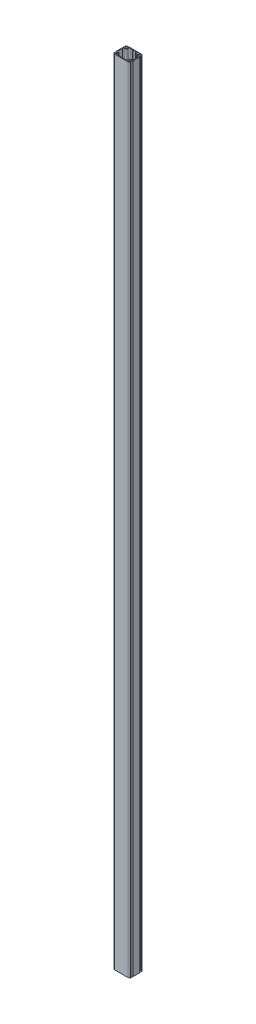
ISO-10303-21;
HEADER;
FILE_DESCRIPTION(('STEP AP214'),'2;1');
FILE_NAME('part.step','',(''),(''),'','','');
FILE_SCHEMA(('AUTOMOTIVE_DESIGN { 1 0 10303 214 1 1 1 1 }'));
ENDSEC;
DATA;
#1=APPLICATION_CONTEXT('core data for automotive mechanical design processes');
#2=APPLICATION_PROTOCOL_DEFINITION('international standard','automotive_design',2000,#1);
#3=PRODUCT_CONTEXT('',#1,'mechanical');
#4=PRODUCT('Part','Part','',(#3));
#5=PRODUCT_RELATED_PRODUCT_CATEGORY('part','',(#4));
#6=PRODUCT_DEFINITION_FORMATION('','',#4);
#7=PRODUCT_DEFINITION_CONTEXT('part definition',#1,'design');
#8=PRODUCT_DEFINITION('design','',#6,#7);
#9=PRODUCT_DEFINITION_SHAPE('','',#8);
#10=(LENGTH_UNIT() NAMED_UNIT(*) SI_UNIT(.MILLI.,.METRE.));
#11=(NAMED_UNIT(*) PLANE_ANGLE_UNIT() SI_UNIT($,.RADIAN.));
#12=(NAMED_UNIT(*) SI_UNIT($,.STERADIAN.) SOLID_ANGLE_UNIT());
#13=UNCERTAINTY_MEASURE_WITH_UNIT(LENGTH_MEASURE(1.E-05),#10,'distance_accuracy_value','');
#14=(GEOMETRIC_REPRESENTATION_CONTEXT(3) GLOBAL_UNCERTAINTY_ASSIGNED_CONTEXT((#13)) GLOBAL_UNIT_ASSIGNED_CONTEXT((#10,
#11,#12)) REPRESENTATION_CONTEXT('',''));
#15=CARTESIAN_POINT('',(0.,0.,0.));
#16=DIRECTION('',(0.,0.,1.));
#17=DIRECTION('',(1.,0.,0.));
#18=AXIS2_PLACEMENT_3D('',#15,#16,#17);
#19=CARTESIAN_POINT('',(-39.5,4753.,-17.8456725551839));
#20=DIRECTION('',(0.,-1.,0.));
#21=DIRECTION('',(0.,0.,-1.));
#22=AXIS2_PLACEMENT_3D('',#19,#20,#21);
#23=CYLINDRICAL_SURFACE('',#22,10.5);
#24=CARTESIAN_POINT('',(-39.5,0.,-17.8456725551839));
#25=DIRECTION('',(0.,1.,0.));
#26=DIRECTION('',(0.,0.,1.));
#27=AXIS2_PLACEMENT_3D('',#24,#25,#26);
#28=CIRCLE('',#27,10.5);
#29=CARTESIAN_POINT('',(-29.,0.,-17.8456725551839));
#30=VERTEX_POINT('',#29);
#31=CARTESIAN_POINT('',(-39.5,0.,-7.34567255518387));
#32=VERTEX_POINT('',#31);
#33=EDGE_CURVE('E493',#30,#32,#28,.F.);
#34=ORIENTED_EDGE('',*,*,#33,.F.);
#35=DIRECTION('',(0.,-1.,0.));
#36=VECTOR('',#35,1.);
#37=CARTESIAN_POINT('',(-29.,4753.,-17.8456725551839));
#38=LINE('',#37,#36);
#39=CARTESIAN_POINT('',(-29.,4753.,-17.8456725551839));
#40=VERTEX_POINT('',#39);
#41=EDGE_CURVE('E11',#40,#30,#38,.T.);
#42=ORIENTED_EDGE('',*,*,#41,.F.);
#43=CARTESIAN_POINT('',(-39.5,4753.,-17.8456725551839));
#44=DIRECTION('',(0.,1.,0.));
#45=DIRECTION('',(0.,0.,1.));
#46=AXIS2_PLACEMENT_3D('',#43,#44,#45);
#47=CIRCLE('',#46,10.5);
#48=CARTESIAN_POINT('',(-39.5,4753.,-7.34567255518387));
#49=VERTEX_POINT('',#48);
#50=EDGE_CURVE('E848',#40,#49,#47,.F.);
#51=ORIENTED_EDGE('',*,*,#50,.T.);
#52=DIRECTION('',(0.,-1.,0.));
#53=VECTOR('',#52,1.);
#54=CARTESIAN_POINT('',(-39.5,4753.,-7.34567255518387));
#55=LINE('',#54,#53);
#56=EDGE_CURVE('E228',#49,#32,#55,.T.);
#57=ORIENTED_EDGE('',*,*,#56,.T.);
#58=EDGE_LOOP('',(#34,#42,#51,#57));
#59=FACE_BOUND('',#58,.T.);
#60=ADVANCED_FACE('F41',(#59),#23,.T.);
#61=CARTESIAN_POINT('',(-22.5,4753.,-17.8456725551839));
#62=DIRECTION('',(0.,-1.,0.));
#63=DIRECTION('',(0.,0.,-1.));
#64=AXIS2_PLACEMENT_3D('',#61,#62,#63);
#65=CYLINDRICAL_SURFACE('',#64,6.49999999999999);
#66=CARTESIAN_POINT('',(-22.5,0.,-17.8456725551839));
#67=DIRECTION('',(0.,1.,0.));
#68=DIRECTION('',(0.,0.,1.));
#69=AXIS2_PLACEMENT_3D('',#66,#67,#68);
#70=CIRCLE('',#69,6.49999999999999);
#71=CARTESIAN_POINT('',(-22.5,0.,-24.3456725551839));
#72=VERTEX_POINT('',#71);
#73=EDGE_CURVE('E496',#30,#72,#70,.F.);
#74=ORIENTED_EDGE('',*,*,#73,.T.);
#75=DIRECTION('',(0.,-1.,0.));
#76=VECTOR('',#75,1.);
#77=CARTESIAN_POINT('',(-22.5,4753.,-24.3456725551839));
#78=LINE('',#77,#76);
#79=CARTESIAN_POINT('',(-22.5,4753.,-24.3456725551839));
#80=VERTEX_POINT('',#79);
#81=EDGE_CURVE('E52',#80,#72,#78,.T.);
#82=ORIENTED_EDGE('',*,*,#81,.F.);
#83=CARTESIAN_POINT('',(-22.5,4753.,-17.8456725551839));
#84=DIRECTION('',(0.,1.,0.));
#85=DIRECTION('',(0.,0.,1.));
#86=AXIS2_PLACEMENT_3D('',#83,#84,#85);
#87=CIRCLE('',#86,6.49999999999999);
#88=EDGE_CURVE('E851',#40,#80,#87,.F.);
#89=ORIENTED_EDGE('',*,*,#88,.F.);
#90=ORIENTED_EDGE('',*,*,#41,.T.);
#91=EDGE_LOOP('',(#74,#82,#89,#90));
#92=FACE_BOUND('',#91,.T.);
#93=ADVANCED_FACE('F971',(#92),#65,.F.);
#94=CARTESIAN_POINT('',(0.,4753.,-24.3456725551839));
#95=DIRECTION('',(0.,0.,-1.));
#96=DIRECTION('',(-1.,0.,0.));
#97=AXIS2_PLACEMENT_3D('',#94,#95,#96);
#98=PLANE('',#97);
#99=DIRECTION('',(1.,0.,0.));
#100=VECTOR('',#99,1.);
#101=CARTESIAN_POINT('',(0.,0.,-24.3456725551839));
#102=LINE('',#101,#100);
#103=CARTESIAN_POINT('',(-12.5,0.,-24.3456725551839));
#104=VERTEX_POINT('',#103);
#105=EDGE_CURVE('E500',#72,#104,#102,.T.);
#106=ORIENTED_EDGE('',*,*,#105,.T.);
#107=DIRECTION('',(0.,-1.,0.));
#108=VECTOR('',#107,1.);
#109=CARTESIAN_POINT('',(-12.5,4753.,-24.3456725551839));
#110=LINE('',#109,#108);
#111=CARTESIAN_POINT('',(-12.5,4753.,-24.3456725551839));
#112=VERTEX_POINT('',#111);
#113=EDGE_CURVE('E699',#112,#104,#110,.T.);
#114=ORIENTED_EDGE('',*,*,#113,.F.);
#115=DIRECTION('',(1.,0.,0.));
#116=VECTOR('',#115,1.);
#117=CARTESIAN_POINT('',(0.,4753.,-24.3456725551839));
#118=LINE('',#117,#116);
#119=EDGE_CURVE('E855',#80,#112,#118,.T.);
#120=ORIENTED_EDGE('',*,*,#119,.F.);
#121=ORIENTED_EDGE('',*,*,#81,.T.);
#122=EDGE_LOOP('',(#106,#114,#120,#121));
#123=FACE_BOUND('',#122,.T.);
#124=ADVANCED_FACE('F976',(#123),#98,.F.);
#125=CARTESIAN_POINT('',(5.92283627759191,4753.,-5.9228362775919));
#126=DIRECTION('',(-0.707106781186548,0.,0.707106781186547));
#127=DIRECTION('',(0.707106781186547,0.,0.707106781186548));
#128=AXIS2_PLACEMENT_3D('',#125,#126,#127);
#129=PLANE('',#128);
#130=DIRECTION('',(-0.707106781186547,0.,-0.707106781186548));
#131=VECTOR('',#130,1.);
#132=CARTESIAN_POINT('',(5.92283627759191,0.,-5.9228362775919));
#133=LINE('',#132,#131);
#134=CARTESIAN_POINT('',(-11.,0.,-22.8456725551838));
#135=VERTEX_POINT('',#134);
#136=EDGE_CURVE('E504',#135,#104,#133,.T.);
#137=ORIENTED_EDGE('',*,*,#136,.F.);
#138=DIRECTION('',(0.,-1.,0.));
#139=VECTOR('',#138,1.);
#140=CARTESIAN_POINT('',(-11.,4753.,-22.8456725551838));
#141=LINE('',#140,#139);
#142=CARTESIAN_POINT('',(-11.,4753.,-22.8456725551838));
#143=VERTEX_POINT('',#142);
#144=EDGE_CURVE('E696',#143,#135,#141,.T.);
#145=ORIENTED_EDGE('',*,*,#144,.F.);
#146=DIRECTION('',(-0.707106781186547,0.,-0.707106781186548));
#147=VECTOR('',#146,1.);
#148=CARTESIAN_POINT('',(5.92283627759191,4753.,-5.9228362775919));
#149=LINE('',#148,#147);
#150=EDGE_CURVE('E858',#143,#112,#149,.T.);
#151=ORIENTED_EDGE('',*,*,#150,.T.);
#152=ORIENTED_EDGE('',*,*,#113,.T.);
#153=EDGE_LOOP('',(#137,#145,#151,#152));
#154=FACE_BOUND('',#153,.T.);
#155=ADVANCED_FACE('F1489',(#154),#129,.T.);
#156=CARTESIAN_POINT('',(0.,4753.,-22.8456725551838));
#157=DIRECTION('',(0.,0.,-1.));
#158=DIRECTION('',(-1.,0.,0.));
#159=AXIS2_PLACEMENT_3D('',#156,#157,#158);
#160=PLANE('',#159);
#161=DIRECTION('',(1.,0.,0.));
#162=VECTOR('',#161,1.);
#163=CARTESIAN_POINT('',(0.,0.,-22.8456725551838));
#164=LINE('',#163,#162);
#165=CARTESIAN_POINT('',(-8.,0.,-22.8456725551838));
#166=VERTEX_POINT('',#165);
#167=EDGE_CURVE('E508',#135,#166,#164,.T.);
#168=ORIENTED_EDGE('',*,*,#167,.T.);
#169=DIRECTION('',(0.,-1.,0.));
#170=VECTOR('',#169,1.);
#171=CARTESIAN_POINT('',(-8.,4753.,-22.8456725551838));
#172=LINE('',#171,#170);
#173=CARTESIAN_POINT('',(-8.,4753.,-22.8456725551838));
#174=VERTEX_POINT('',#173);
#175=EDGE_CURVE('E692',#174,#166,#172,.T.);
#176=ORIENTED_EDGE('',*,*,#175,.F.);
#177=DIRECTION('',(1.,0.,0.));
#178=VECTOR('',#177,1.);
#179=CARTESIAN_POINT('',(0.,4753.,-22.8456725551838));
#180=LINE('',#179,#178);
#181=EDGE_CURVE('E862',#143,#174,#180,.T.);
#182=ORIENTED_EDGE('',*,*,#181,.F.);
#183=ORIENTED_EDGE('',*,*,#144,.T.);
#184=EDGE_LOOP('',(#168,#176,#182,#183));
#185=FACE_BOUND('',#184,.T.);
#186=ADVANCED_FACE('F1479',(#185),#160,.F.);
#187=CARTESIAN_POINT('',(-15.4228362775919,4753.,-15.422836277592));
#188=DIRECTION('',(-0.707106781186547,0.,-0.707106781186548));
#189=DIRECTION('',(-0.707106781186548,0.,0.707106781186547));
#190=AXIS2_PLACEMENT_3D('',#187,#188,#189);
#191=PLANE('',#190);
#192=DIRECTION('',(0.707106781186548,0.,-0.707106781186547));
#193=VECTOR('',#192,1.);
#194=CARTESIAN_POINT('',(-15.4228362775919,0.,-15.422836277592));
#195=LINE('',#194,#193);
#196=CARTESIAN_POINT('',(-6.50000000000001,0.,-24.3456725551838));
#197=VERTEX_POINT('',#196);
#198=EDGE_CURVE('E512',#166,#197,#195,.T.);
#199=ORIENTED_EDGE('',*,*,#198,.T.);
#200=DIRECTION('',(0.,-1.,0.));
#201=VECTOR('',#200,1.);
#202=CARTESIAN_POINT('',(-6.50000000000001,4753.,-24.3456725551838));
#203=LINE('',#202,#201);
#204=CARTESIAN_POINT('',(-6.50000000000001,4753.,-24.3456725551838));
#205=VERTEX_POINT('',#204);
#206=EDGE_CURVE('E689',#205,#197,#203,.T.);
#207=ORIENTED_EDGE('',*,*,#206,.F.);
#208=DIRECTION('',(0.707106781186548,0.,-0.707106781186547));
#209=VECTOR('',#208,1.);
#210=CARTESIAN_POINT('',(-15.4228362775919,4753.,-15.422836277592));
#211=LINE('',#210,#209);
#212=EDGE_CURVE('E866',#174,#205,#211,.T.);
#213=ORIENTED_EDGE('',*,*,#212,.F.);
#214=ORIENTED_EDGE('',*,*,#175,.T.);
#215=EDGE_LOOP('',(#199,#207,#213,#214));
#216=FACE_BOUND('',#215,.T.);
#217=ADVANCED_FACE('F1468',(#216),#191,.F.);
#218=CARTESIAN_POINT('',(0.,4753.,-24.3456725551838));
#219=DIRECTION('',(0.,0.,1.));
#220=DIRECTION('',(1.,0.,0.));
#221=AXIS2_PLACEMENT_3D('',#218,#219,#220);
#222=PLANE('',#221);
#223=DIRECTION('',(-1.,0.,0.));
#224=VECTOR('',#223,1.);
#225=CARTESIAN_POINT('',(0.,0.,-24.3456725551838));
#226=LINE('',#225,#224);
#227=CARTESIAN_POINT('',(6.50000000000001,0.,-24.3456725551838));
#228=VERTEX_POINT('',#227);
#229=EDGE_CURVE('E516',#228,#197,#226,.T.);
#230=ORIENTED_EDGE('',*,*,#229,.F.);
#231=DIRECTION('',(0.,-1.,0.));
#232=VECTOR('',#231,1.);
#233=CARTESIAN_POINT('',(6.50000000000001,4753.,-24.3456725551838));
#234=LINE('',#233,#232);
#235=CARTESIAN_POINT('',(6.50000000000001,4753.,-24.3456725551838));
#236=VERTEX_POINT('',#235);
#237=EDGE_CURVE('E686',#236,#228,#234,.T.);
#238=ORIENTED_EDGE('',*,*,#237,.F.);
#239=DIRECTION('',(-1.,0.,0.));
#240=VECTOR('',#239,1.);
#241=CARTESIAN_POINT('',(0.,4753.,-24.3456725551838));
#242=LINE('',#241,#240);
#243=EDGE_CURVE('E869',#236,#205,#242,.T.);
#244=ORIENTED_EDGE('',*,*,#243,.T.);
#245=ORIENTED_EDGE('',*,*,#206,.T.);
#246=EDGE_LOOP('',(#230,#238,#244,#245));
#247=FACE_BOUND('',#246,.T.);
#248=ADVANCED_FACE('F1458',(#247),#222,.T.);
#249=CARTESIAN_POINT('',(15.4228362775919,4753.,-15.422836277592));
#250=DIRECTION('',(-0.707106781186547,0.,0.707106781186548));
#251=DIRECTION('',(0.707106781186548,0.,0.707106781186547));
#252=AXIS2_PLACEMENT_3D('',#249,#250,#251);
#253=PLANE('',#252);
#254=DIRECTION('',(-0.707106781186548,0.,-0.707106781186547));
#255=VECTOR('',#254,1.);
#256=CARTESIAN_POINT('',(15.4228362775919,0.,-15.422836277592));
#257=LINE('',#256,#255);
#258=CARTESIAN_POINT('',(8.,0.,-22.8456725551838));
#259=VERTEX_POINT('',#258);
#260=EDGE_CURVE('E520',#259,#228,#257,.T.);
#261=ORIENTED_EDGE('',*,*,#260,.F.);
#262=DIRECTION('',(0.,-1.,0.));
#263=VECTOR('',#262,1.);
#264=CARTESIAN_POINT('',(8.,4753.,-22.8456725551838));
#265=LINE('',#264,#263);
#266=CARTESIAN_POINT('',(8.,4753.,-22.8456725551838));
#267=VERTEX_POINT('',#266);
#268=EDGE_CURVE('E683',#267,#259,#265,.T.);
#269=ORIENTED_EDGE('',*,*,#268,.F.);
#270=DIRECTION('',(-0.707106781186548,0.,-0.707106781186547));
#271=VECTOR('',#270,1.);
#272=CARTESIAN_POINT('',(15.4228362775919,4753.,-15.422836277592));
#273=LINE('',#272,#271);
#274=EDGE_CURVE('E873',#267,#236,#273,.T.);
#275=ORIENTED_EDGE('',*,*,#274,.T.);
#276=ORIENTED_EDGE('',*,*,#237,.T.);
#277=EDGE_LOOP('',(#261,#269,#275,#276));
#278=FACE_BOUND('',#277,.T.);
#279=ADVANCED_FACE('F1448',(#278),#253,.T.);
#280=CARTESIAN_POINT('',(0.,4753.,-22.8456725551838));
#281=DIRECTION('',(0.,0.,1.));
#282=DIRECTION('',(1.,0.,0.));
#283=AXIS2_PLACEMENT_3D('',#280,#281,#282);
#284=PLANE('',#283);
#285=DIRECTION('',(-1.,0.,0.));
#286=VECTOR('',#285,1.);
#287=CARTESIAN_POINT('',(0.,0.,-22.8456725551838));
#288=LINE('',#287,#286);
#289=CARTESIAN_POINT('',(11.,0.,-22.8456725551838));
#290=VERTEX_POINT('',#289);
#291=EDGE_CURVE('E524',#290,#259,#288,.T.);
#292=ORIENTED_EDGE('',*,*,#291,.F.);
#293=DIRECTION('',(0.,-1.,0.));
#294=VECTOR('',#293,1.);
#295=CARTESIAN_POINT('',(11.,4753.,-22.8456725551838));
#296=LINE('',#295,#294);
#297=CARTESIAN_POINT('',(11.,4753.,-22.8456725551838));
#298=VERTEX_POINT('',#297);
#299=EDGE_CURVE('E680',#298,#290,#296,.T.);
#300=ORIENTED_EDGE('',*,*,#299,.F.);
#301=DIRECTION('',(-1.,0.,0.));
#302=VECTOR('',#301,1.);
#303=CARTESIAN_POINT('',(0.,4753.,-22.8456725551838));
#304=LINE('',#303,#302);
#305=EDGE_CURVE('E877',#298,#267,#304,.T.);
#306=ORIENTED_EDGE('',*,*,#305,.T.);
#307=ORIENTED_EDGE('',*,*,#268,.T.);
#308=EDGE_LOOP('',(#292,#300,#306,#307));
#309=FACE_BOUND('',#308,.T.);
#310=ADVANCED_FACE('F1438',(#309),#284,.T.);
#311=CARTESIAN_POINT('',(-5.92283627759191,4753.,-5.9228362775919));
#312=DIRECTION('',(-0.707106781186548,0.,-0.707106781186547));
#313=DIRECTION('',(-0.707106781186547,0.,0.707106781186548));
#314=AXIS2_PLACEMENT_3D('',#311,#312,#313);
#315=PLANE('',#314);
#316=DIRECTION('',(0.707106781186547,0.,-0.707106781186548));
#317=VECTOR('',#316,1.);
#318=CARTESIAN_POINT('',(-5.92283627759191,0.,-5.9228362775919));
#319=LINE('',#318,#317);
#320=CARTESIAN_POINT('',(12.5,0.,-24.3456725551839));
#321=VERTEX_POINT('',#320);
#322=EDGE_CURVE('E528',#290,#321,#319,.T.);
#323=ORIENTED_EDGE('',*,*,#322,.T.);
#324=DIRECTION('',(0.,-1.,0.));
#325=VECTOR('',#324,1.);
#326=CARTESIAN_POINT('',(12.5,4753.,-24.3456725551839));
#327=LINE('',#326,#325);
#328=CARTESIAN_POINT('',(12.5,4753.,-24.3456725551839));
#329=VERTEX_POINT('',#328);
#330=EDGE_CURVE('E677',#329,#321,#327,.T.);
#331=ORIENTED_EDGE('',*,*,#330,.F.);
#332=DIRECTION('',(0.707106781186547,0.,-0.707106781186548));
#333=VECTOR('',#332,1.);
#334=CARTESIAN_POINT('',(-5.92283627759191,4753.,-5.9228362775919));
#335=LINE('',#334,#333);
#336=EDGE_CURVE('E881',#298,#329,#335,.T.);
#337=ORIENTED_EDGE('',*,*,#336,.F.);
#338=ORIENTED_EDGE('',*,*,#299,.T.);
#339=EDGE_LOOP('',(#323,#331,#337,#338));
#340=FACE_BOUND('',#339,.T.);
#341=ADVANCED_FACE('F1427',(#340),#315,.F.);
#342=CARTESIAN_POINT('',(0.,4753.,-24.3456725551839));
#343=DIRECTION('',(0.,0.,1.));
#344=DIRECTION('',(1.,0.,0.));
#345=AXIS2_PLACEMENT_3D('',#342,#343,#344);
#346=PLANE('',#345);
#347=DIRECTION('',(-1.,0.,0.));
#348=VECTOR('',#347,1.);
#349=CARTESIAN_POINT('',(0.,0.,-24.3456725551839));
#350=LINE('',#349,#348);
#351=CARTESIAN_POINT('',(22.5,0.,-24.3456725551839));
#352=VERTEX_POINT('',#351);
#353=EDGE_CURVE('E532',#352,#321,#350,.T.);
#354=ORIENTED_EDGE('',*,*,#353,.F.);
#355=DIRECTION('',(0.,-1.,0.));
#356=VECTOR('',#355,1.);
#357=CARTESIAN_POINT('',(22.5,4753.,-24.3456725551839));
#358=LINE('',#357,#356);
#359=CARTESIAN_POINT('',(22.5,4753.,-24.3456725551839));
#360=VERTEX_POINT('',#359);
#361=EDGE_CURVE('E674',#360,#352,#358,.T.);
#362=ORIENTED_EDGE('',*,*,#361,.F.);
#363=DIRECTION('',(-1.,0.,0.));
#364=VECTOR('',#363,1.);
#365=CARTESIAN_POINT('',(0.,4753.,-24.3456725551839));
#366=LINE('',#365,#364);
#367=EDGE_CURVE('E884',#360,#329,#366,.T.);
#368=ORIENTED_EDGE('',*,*,#367,.T.);
#369=ORIENTED_EDGE('',*,*,#330,.T.);
#370=EDGE_LOOP('',(#354,#362,#368,#369));
#371=FACE_BOUND('',#370,.T.);
#372=ADVANCED_FACE('F1417',(#371),#346,.T.);
#373=CARTESIAN_POINT('',(22.5,4753.,-17.8456725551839));
#374=DIRECTION('',(0.,-1.,0.));
#375=DIRECTION('',(0.,0.,-1.));
#376=AXIS2_PLACEMENT_3D('',#373,#374,#375);
#377=CYLINDRICAL_SURFACE('',#376,6.49999999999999);
#378=CARTESIAN_POINT('',(22.5,0.,-17.8456725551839));
#379=DIRECTION('',(0.,1.,0.));
#380=DIRECTION('',(0.,0.,1.));
#381=AXIS2_PLACEMENT_3D('',#378,#379,#380);
#382=CIRCLE('',#381,6.49999999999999);
#383=CARTESIAN_POINT('',(29.,0.,-17.8456725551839));
#384=VERTEX_POINT('',#383);
#385=EDGE_CURVE('E536',#384,#352,#382,.T.);
#386=ORIENTED_EDGE('',*,*,#385,.F.);
#387=DIRECTION('',(0.,-1.,0.));
#388=VECTOR('',#387,1.);
#389=CARTESIAN_POINT('',(29.,4753.,-17.8456725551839));
#390=LINE('',#389,#388);
#391=CARTESIAN_POINT('',(29.,4753.,-17.8456725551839));
#392=VERTEX_POINT('',#391);
#393=EDGE_CURVE('E671',#392,#384,#390,.T.);
#394=ORIENTED_EDGE('',*,*,#393,.F.);
#395=CARTESIAN_POINT('',(22.5,4753.,-17.8456725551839));
#396=DIRECTION('',(0.,1.,0.));
#397=DIRECTION('',(0.,0.,1.));
#398=AXIS2_PLACEMENT_3D('',#395,#396,#397);
#399=CIRCLE('',#398,6.49999999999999);
#400=EDGE_CURVE('E888',#392,#360,#399,.T.);
#401=ORIENTED_EDGE('',*,*,#400,.T.);
#402=ORIENTED_EDGE('',*,*,#361,.T.);
#403=EDGE_LOOP('',(#386,#394,#401,#402));
#404=FACE_BOUND('',#403,.T.);
#405=ADVANCED_FACE('F1407',(#404),#377,.F.);
#406=CARTESIAN_POINT('',(39.5,4753.,-17.8456725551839));
#407=DIRECTION('',(0.,-1.,0.));
#408=DIRECTION('',(0.,0.,-1.));
#409=AXIS2_PLACEMENT_3D('',#406,#407,#408);
#410=CYLINDRICAL_SURFACE('',#409,10.5);
#411=CARTESIAN_POINT('',(39.5,0.,-17.8456725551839));
#412=DIRECTION('',(0.,1.,0.));
#413=DIRECTION('',(0.,0.,1.));
#414=AXIS2_PLACEMENT_3D('',#411,#412,#413);
#415=CIRCLE('',#414,10.5);
#416=CARTESIAN_POINT('',(39.5,0.,-7.34567255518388));
#417=VERTEX_POINT('',#416);
#418=EDGE_CURVE('E540',#384,#417,#415,.T.);
#419=ORIENTED_EDGE('',*,*,#418,.T.);
#420=DIRECTION('',(0.,-1.,0.));
#421=VECTOR('',#420,1.);
#422=CARTESIAN_POINT('',(39.5,4753.,-7.34567255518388));
#423=LINE('',#422,#421);
#424=CARTESIAN_POINT('',(39.5,4753.,-7.34567255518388));
#425=VERTEX_POINT('',#424);
#426=EDGE_CURVE('E668',#425,#417,#423,.T.);
#427=ORIENTED_EDGE('',*,*,#426,.F.);
#428=CARTESIAN_POINT('',(39.5,4753.,-17.8456725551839));
#429=DIRECTION('',(0.,1.,0.));
#430=DIRECTION('',(0.,0.,1.));
#431=AXIS2_PLACEMENT_3D('',#428,#429,#430);
#432=CIRCLE('',#431,10.5);
#433=EDGE_CURVE('E892',#392,#425,#432,.T.);
#434=ORIENTED_EDGE('',*,*,#433,.F.);
#435=ORIENTED_EDGE('',*,*,#393,.T.);
#436=EDGE_LOOP('',(#419,#427,#434,#435));
#437=FACE_BOUND('',#436,.T.);
#438=ADVANCED_FACE('F1397',(#437),#410,.T.);
#439=CARTESIAN_POINT('',(39.5,4753.,-0.845672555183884));
#440=DIRECTION('',(0.,-1.,0.));
#441=DIRECTION('',(0.,0.,-1.));
#442=AXIS2_PLACEMENT_3D('',#439,#440,#441);
#443=CYLINDRICAL_SURFACE('',#442,6.49999999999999);
#444=CARTESIAN_POINT('',(39.5,0.,-0.845672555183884));
#445=DIRECTION('',(0.,1.,0.));
#446=DIRECTION('',(0.,0.,1.));
#447=AXIS2_PLACEMENT_3D('',#444,#445,#446);
#448=CIRCLE('',#447,6.49999999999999);
#449=CARTESIAN_POINT('',(46.,0.,-0.845672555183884));
#450=VERTEX_POINT('',#449);
#451=EDGE_CURVE('E544',#450,#417,#448,.T.);
#452=ORIENTED_EDGE('',*,*,#451,.F.);
#453=DIRECTION('',(0.,-1.,0.));
#454=VECTOR('',#453,1.);
#455=CARTESIAN_POINT('',(46.,4753.,-0.845672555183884));
#456=LINE('',#455,#454);
#457=CARTESIAN_POINT('',(46.,4753.,-0.845672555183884));
#458=VERTEX_POINT('',#457);
#459=EDGE_CURVE('E665',#458,#450,#456,.T.);
#460=ORIENTED_EDGE('',*,*,#459,.F.);
#461=CARTESIAN_POINT('',(39.5,4753.,-0.845672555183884));
#462=DIRECTION('',(0.,1.,0.));
#463=DIRECTION('',(0.,0.,1.));
#464=AXIS2_PLACEMENT_3D('',#461,#462,#463);
#465=CIRCLE('',#464,6.49999999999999);
#466=EDGE_CURVE('E895',#458,#425,#465,.T.);
#467=ORIENTED_EDGE('',*,*,#466,.T.);
#468=ORIENTED_EDGE('',*,*,#426,.T.);
#469=EDGE_LOOP('',(#452,#460,#467,#468));
#470=FACE_BOUND('',#469,.T.);
#471=ADVANCED_FACE('F1386',(#470),#443,.F.);
#472=CARTESIAN_POINT('',(46.,4753.,0.));
#473=DIRECTION('',(-1.,0.,0.));
#474=DIRECTION('',(0.,0.,1.));
#475=AXIS2_PLACEMENT_3D('',#472,#473,#474);
#476=PLANE('',#475);
#477=DIRECTION('',(0.,0.,-1.));
#478=VECTOR('',#477,1.);
#479=CARTESIAN_POINT('',(46.,0.,0.));
#480=LINE('',#479,#478);
#481=CARTESIAN_POINT('',(46.,0.,24.1543274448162));
#482=VERTEX_POINT('',#481);
#483=EDGE_CURVE('E548',#482,#450,#480,.T.);
#484=ORIENTED_EDGE('',*,*,#483,.F.);
#485=DIRECTION('',(0.,-1.,0.));
#486=VECTOR('',#485,1.);
#487=CARTESIAN_POINT('',(46.,4753.,24.1543274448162));
#488=LINE('',#487,#486);
#489=CARTESIAN_POINT('',(46.,4753.,24.1543274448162));
#490=VERTEX_POINT('',#489);
#491=EDGE_CURVE('E662',#490,#482,#488,.T.);
#492=ORIENTED_EDGE('',*,*,#491,.F.);
#493=DIRECTION('',(0.,0.,-1.));
#494=VECTOR('',#493,1.);
#495=CARTESIAN_POINT('',(46.,4753.,0.));
#496=LINE('',#495,#494);
#497=EDGE_CURVE('E899',#490,#458,#496,.T.);
#498=ORIENTED_EDGE('',*,*,#497,.T.);
#499=ORIENTED_EDGE('',*,*,#459,.T.);
#500=EDGE_LOOP('',(#484,#492,#498,#499));
#501=FACE_BOUND('',#500,.T.);
#502=ADVANCED_FACE('F1376',(#501),#476,.T.);
#503=CARTESIAN_POINT('',(39.5,4753.,24.1543274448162));
#504=DIRECTION('',(0.,-1.,0.));
#505=DIRECTION('',(0.,0.,-1.));
#506=AXIS2_PLACEMENT_3D('',#503,#504,#505);
#507=CYLINDRICAL_SURFACE('',#506,6.49999999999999);
#508=CARTESIAN_POINT('',(39.5,0.,24.1543274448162));
#509=DIRECTION('',(0.,1.,0.));
#510=DIRECTION('',(0.,0.,1.));
#511=AXIS2_PLACEMENT_3D('',#508,#509,#510);
#512=CIRCLE('',#511,6.49999999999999);
#513=CARTESIAN_POINT('',(39.5,0.,30.6543274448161));
#514=VERTEX_POINT('',#513);
#515=EDGE_CURVE('E552',#482,#514,#512,.F.);
#516=ORIENTED_EDGE('',*,*,#515,.T.);
#517=DIRECTION('',(0.,-1.,0.));
#518=VECTOR('',#517,1.);
#519=CARTESIAN_POINT('',(39.5,4753.,30.6543274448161));
#520=LINE('',#519,#518);
#521=CARTESIAN_POINT('',(39.5,4753.,30.6543274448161));
#522=VERTEX_POINT('',#521);
#523=EDGE_CURVE('E659',#522,#514,#520,.T.);
#524=ORIENTED_EDGE('',*,*,#523,.F.);
#525=CARTESIAN_POINT('',(39.5,4753.,24.1543274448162));
#526=DIRECTION('',(0.,1.,0.));
#527=DIRECTION('',(0.,0.,1.));
#528=AXIS2_PLACEMENT_3D('',#525,#526,#527);
#529=CIRCLE('',#528,6.49999999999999);
#530=EDGE_CURVE('E903',#490,#522,#529,.F.);
#531=ORIENTED_EDGE('',*,*,#530,.F.);
#532=ORIENTED_EDGE('',*,*,#491,.T.);
#533=EDGE_LOOP('',(#516,#524,#531,#532));
#534=FACE_BOUND('',#533,.T.);
#535=ADVANCED_FACE('F1366',(#534),#507,.F.);
#536=CARTESIAN_POINT('',(39.5,4753.,41.1543274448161));
#537=DIRECTION('',(0.,-1.,0.));
#538=DIRECTION('',(0.,0.,-1.));
#539=AXIS2_PLACEMENT_3D('',#536,#537,#538);
#540=CYLINDRICAL_SURFACE('',#539,10.5);
#541=CARTESIAN_POINT('',(39.5,0.,41.1543274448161));
#542=DIRECTION('',(0.,1.,0.));
#543=DIRECTION('',(0.,0.,1.));
#544=AXIS2_PLACEMENT_3D('',#541,#542,#543);
#545=CIRCLE('',#544,10.5);
#546=CARTESIAN_POINT('',(29.,0.,41.1543274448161));
#547=VERTEX_POINT('',#546);
#548=EDGE_CURVE('E556',#547,#514,#545,.F.);
#549=ORIENTED_EDGE('',*,*,#548,.F.);
#550=DIRECTION('',(0.,-1.,0.));
#551=VECTOR('',#550,1.);
#552=CARTESIAN_POINT('',(29.,4753.,41.1543274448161));
#553=LINE('',#552,#551);
#554=CARTESIAN_POINT('',(29.,4753.,41.1543274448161));
#555=VERTEX_POINT('',#554);
#556=EDGE_CURVE('E656',#555,#547,#553,.T.);
#557=ORIENTED_EDGE('',*,*,#556,.F.);
#558=CARTESIAN_POINT('',(39.5,4753.,41.1543274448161));
#559=DIRECTION('',(0.,1.,0.));
#560=DIRECTION('',(0.,0.,1.));
#561=AXIS2_PLACEMENT_3D('',#558,#559,#560);
#562=CIRCLE('',#561,10.5);
#563=EDGE_CURVE('E906',#555,#522,#562,.F.);
#564=ORIENTED_EDGE('',*,*,#563,.T.);
#565=ORIENTED_EDGE('',*,*,#523,.T.);
#566=EDGE_LOOP('',(#549,#557,#564,#565));
#567=FACE_BOUND('',#566,.T.);
#568=ADVANCED_FACE('F1356',(#567),#540,.T.);
#569=CARTESIAN_POINT('',(22.5,4753.,41.1543274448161));
#570=DIRECTION('',(0.,-1.,0.));
#571=DIRECTION('',(0.,0.,-1.));
#572=AXIS2_PLACEMENT_3D('',#569,#570,#571);
#573=CYLINDRICAL_SURFACE('',#572,6.5);
#574=CARTESIAN_POINT('',(22.5,0.,41.1543274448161));
#575=DIRECTION('',(0.,1.,0.));
#576=DIRECTION('',(0.,0.,1.));
#577=AXIS2_PLACEMENT_3D('',#574,#575,#576);
#578=CIRCLE('',#577,6.5);
#579=CARTESIAN_POINT('',(22.5,0.,47.6543274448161));
#580=VERTEX_POINT('',#579);
#581=EDGE_CURVE('E560',#547,#580,#578,.F.);
#582=ORIENTED_EDGE('',*,*,#581,.T.);
#583=DIRECTION('',(0.,-1.,0.));
#584=VECTOR('',#583,1.);
#585=CARTESIAN_POINT('',(22.5,4753.,47.6543274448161));
#586=LINE('',#585,#584);
#587=CARTESIAN_POINT('',(22.5,4753.,47.6543274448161));
#588=VERTEX_POINT('',#587);
#589=EDGE_CURVE('E653',#588,#580,#586,.T.);
#590=ORIENTED_EDGE('',*,*,#589,.F.);
#591=CARTESIAN_POINT('',(22.5,4753.,41.1543274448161));
#592=DIRECTION('',(0.,1.,0.));
#593=DIRECTION('',(0.,0.,1.));
#594=AXIS2_PLACEMENT_3D('',#591,#592,#593);
#595=CIRCLE('',#594,6.5);
#596=EDGE_CURVE('E910',#555,#588,#595,.F.);
#597=ORIENTED_EDGE('',*,*,#596,.F.);
#598=ORIENTED_EDGE('',*,*,#556,.T.);
#599=EDGE_LOOP('',(#582,#590,#597,#598));
#600=FACE_BOUND('',#599,.T.);
#601=ADVANCED_FACE('F1346',(#600),#573,.F.);
#602=CARTESIAN_POINT('',(0.,4753.,47.6543274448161));
#603=DIRECTION('',(0.,0.,-1.));
#604=DIRECTION('',(-1.,0.,0.));
#605=AXIS2_PLACEMENT_3D('',#602,#603,#604);
#606=PLANE('',#605);
#607=DIRECTION('',(1.,0.,0.));
#608=VECTOR('',#607,1.);
#609=CARTESIAN_POINT('',(0.,0.,47.6543274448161));
#610=LINE('',#609,#608);
#611=CARTESIAN_POINT('',(12.5,0.,47.6543274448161));
#612=VERTEX_POINT('',#611);
#613=EDGE_CURVE('E564',#612,#580,#610,.T.);
#614=ORIENTED_EDGE('',*,*,#613,.F.);
#615=DIRECTION('',(0.,-1.,0.));
#616=VECTOR('',#615,1.);
#617=CARTESIAN_POINT('',(12.5,4753.,47.6543274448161));
#618=LINE('',#617,#616);
#619=CARTESIAN_POINT('',(12.5,4753.,47.6543274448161));
#620=VERTEX_POINT('',#619);
#621=EDGE_CURVE('E650',#620,#612,#618,.T.);
#622=ORIENTED_EDGE('',*,*,#621,.F.);
#623=DIRECTION('',(1.,0.,0.));
#624=VECTOR('',#623,1.);
#625=CARTESIAN_POINT('',(0.,4753.,47.6543274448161));
#626=LINE('',#625,#624);
#627=EDGE_CURVE('E913',#620,#588,#626,.T.);
#628=ORIENTED_EDGE('',*,*,#627,.T.);
#629=ORIENTED_EDGE('',*,*,#589,.T.);
#630=EDGE_LOOP('',(#614,#622,#628,#629));
#631=FACE_BOUND('',#630,.T.);
#632=ADVANCED_FACE('F1336',(#631),#606,.T.);
#633=CARTESIAN_POINT('',(-17.577163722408,4753.,17.577163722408));
#634=DIRECTION('',(0.707106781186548,0.,-0.707106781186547));
#635=DIRECTION('',(-0.707106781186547,0.,-0.707106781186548));
#636=AXIS2_PLACEMENT_3D('',#633,#634,#635);
#637=PLANE('',#636);
#638=DIRECTION('',(0.707106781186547,0.,0.707106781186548));
#639=VECTOR('',#638,1.);
#640=CARTESIAN_POINT('',(-17.577163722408,0.,17.577163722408));
#641=LINE('',#640,#639);
#642=CARTESIAN_POINT('',(11.,0.,46.1543274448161));
#643=VERTEX_POINT('',#642);
#644=EDGE_CURVE('E568',#643,#612,#641,.T.);
#645=ORIENTED_EDGE('',*,*,#644,.F.);
#646=DIRECTION('',(0.,-1.,0.));
#647=VECTOR('',#646,1.);
#648=CARTESIAN_POINT('',(11.,4753.,46.1543274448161));
#649=LINE('',#648,#647);
#650=CARTESIAN_POINT('',(11.,4753.,46.1543274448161));
#651=VERTEX_POINT('',#650);
#652=EDGE_CURVE('E647',#651,#643,#649,.T.);
#653=ORIENTED_EDGE('',*,*,#652,.F.);
#654=DIRECTION('',(0.707106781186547,0.,0.707106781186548));
#655=VECTOR('',#654,1.);
#656=CARTESIAN_POINT('',(-17.577163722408,4753.,17.577163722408));
#657=LINE('',#656,#655);
#658=EDGE_CURVE('E917',#651,#620,#657,.T.);
#659=ORIENTED_EDGE('',*,*,#658,.T.);
#660=ORIENTED_EDGE('',*,*,#621,.T.);
#661=EDGE_LOOP('',(#645,#653,#659,#660));
#662=FACE_BOUND('',#661,.T.);
#663=ADVANCED_FACE('F1326',(#662),#637,.T.);
#664=CARTESIAN_POINT('',(0.,4753.,46.1543274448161));
#665=DIRECTION('',(0.,0.,1.));
#666=DIRECTION('',(1.,0.,0.));
#667=AXIS2_PLACEMENT_3D('',#664,#665,#666);
#668=PLANE('',#667);
#669=DIRECTION('',(-1.,0.,0.));
#670=VECTOR('',#669,1.);
#671=CARTESIAN_POINT('',(0.,0.,46.1543274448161));
#672=LINE('',#671,#670);
#673=CARTESIAN_POINT('',(8.,0.,46.1543274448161));
#674=VERTEX_POINT('',#673);
#675=EDGE_CURVE('E572',#643,#674,#672,.T.);
#676=ORIENTED_EDGE('',*,*,#675,.T.);
#677=DIRECTION('',(0.,-1.,0.));
#678=VECTOR('',#677,1.);
#679=CARTESIAN_POINT('',(8.,4753.,46.1543274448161));
#680=LINE('',#679,#678);
#681=CARTESIAN_POINT('',(8.,4753.,46.1543274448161));
#682=VERTEX_POINT('',#681);
#683=EDGE_CURVE('E643',#682,#674,#680,.T.);
#684=ORIENTED_EDGE('',*,*,#683,.F.);
#685=DIRECTION('',(-1.,0.,0.));
#686=VECTOR('',#685,1.);
#687=CARTESIAN_POINT('',(0.,4753.,46.1543274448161));
#688=LINE('',#687,#686);
#689=EDGE_CURVE('E921',#651,#682,#688,.T.);
#690=ORIENTED_EDGE('',*,*,#689,.F.);
#691=ORIENTED_EDGE('',*,*,#652,.T.);
#692=EDGE_LOOP('',(#676,#684,#690,#691));
#693=FACE_BOUND('',#692,.T.);
#694=ADVANCED_FACE('F1316',(#693),#668,.F.);
#695=CARTESIAN_POINT('',(27.077163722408,4753.,27.0771637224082));
#696=DIRECTION('',(0.707106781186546,0.,0.707106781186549));
#697=DIRECTION('',(0.707106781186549,0.,-0.707106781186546));
#698=AXIS2_PLACEMENT_3D('',#695,#696,#697);
#699=PLANE('',#698);
#700=DIRECTION('',(-0.707106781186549,0.,0.707106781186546));
#701=VECTOR('',#700,1.);
#702=CARTESIAN_POINT('',(27.077163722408,0.,27.0771637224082));
#703=LINE('',#702,#701);
#704=CARTESIAN_POINT('',(6.50000000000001,0.,47.6543274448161));
#705=VERTEX_POINT('',#704);
#706=EDGE_CURVE('E576',#674,#705,#703,.T.);
#707=ORIENTED_EDGE('',*,*,#706,.T.);
#708=DIRECTION('',(0.,-1.,0.));
#709=VECTOR('',#708,1.);
#710=CARTESIAN_POINT('',(6.50000000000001,4753.,47.6543274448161));
#711=LINE('',#710,#709);
#712=CARTESIAN_POINT('',(6.50000000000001,4753.,47.6543274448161));
#713=VERTEX_POINT('',#712);
#714=EDGE_CURVE('E640',#713,#705,#711,.T.);
#715=ORIENTED_EDGE('',*,*,#714,.F.);
#716=DIRECTION('',(-0.707106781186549,0.,0.707106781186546));
#717=VECTOR('',#716,1.);
#718=CARTESIAN_POINT('',(27.077163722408,4753.,27.0771637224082));
#719=LINE('',#718,#717);
#720=EDGE_CURVE('E925',#682,#713,#719,.T.);
#721=ORIENTED_EDGE('',*,*,#720,.F.);
#722=ORIENTED_EDGE('',*,*,#683,.T.);
#723=EDGE_LOOP('',(#707,#715,#721,#722));
#724=FACE_BOUND('',#723,.T.);
#725=ADVANCED_FACE('F1306',(#724),#699,.F.);
#726=CARTESIAN_POINT('',(0.,4753.,47.6543274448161));
#727=DIRECTION('',(0.,0.,-1.));
#728=DIRECTION('',(-1.,0.,0.));
#729=AXIS2_PLACEMENT_3D('',#726,#727,#728);
#730=PLANE('',#729);
#731=DIRECTION('',(1.,0.,0.));
#732=VECTOR('',#731,1.);
#733=CARTESIAN_POINT('',(0.,0.,47.6543274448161));
#734=LINE('',#733,#732);
#735=CARTESIAN_POINT('',(-6.50000000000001,0.,47.6543274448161));
#736=VERTEX_POINT('',#735);
#737=EDGE_CURVE('E580',#736,#705,#734,.T.);
#738=ORIENTED_EDGE('',*,*,#737,.F.);
#739=DIRECTION('',(0.,-1.,0.));
#740=VECTOR('',#739,1.);
#741=CARTESIAN_POINT('',(-6.50000000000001,4753.,47.6543274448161));
#742=LINE('',#741,#740);
#743=CARTESIAN_POINT('',(-6.50000000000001,4753.,47.6543274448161));
#744=VERTEX_POINT('',#743);
#745=EDGE_CURVE('E637',#744,#736,#742,.T.);
#746=ORIENTED_EDGE('',*,*,#745,.F.);
#747=DIRECTION('',(1.,0.,0.));
#748=VECTOR('',#747,1.);
#749=CARTESIAN_POINT('',(0.,4753.,47.6543274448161));
#750=LINE('',#749,#748);
#751=EDGE_CURVE('E928',#744,#713,#750,.T.);
#752=ORIENTED_EDGE('',*,*,#751,.T.);
#753=ORIENTED_EDGE('',*,*,#714,.T.);
#754=EDGE_LOOP('',(#738,#746,#752,#753));
#755=FACE_BOUND('',#754,.T.);
#756=ADVANCED_FACE('F1296',(#755),#730,.T.);
#757=CARTESIAN_POINT('',(-27.077163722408,4753.,27.0771637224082));
#758=DIRECTION('',(0.707106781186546,0.,-0.707106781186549));
#759=DIRECTION('',(-0.707106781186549,0.,-0.707106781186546));
#760=AXIS2_PLACEMENT_3D('',#757,#758,#759);
#761=PLANE('',#760);
#762=DIRECTION('',(0.707106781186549,0.,0.707106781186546));
#763=VECTOR('',#762,1.);
#764=CARTESIAN_POINT('',(-27.077163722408,0.,27.0771637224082));
#765=LINE('',#764,#763);
#766=CARTESIAN_POINT('',(-8.,0.,46.1543274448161));
#767=VERTEX_POINT('',#766);
#768=EDGE_CURVE('E584',#767,#736,#765,.T.);
#769=ORIENTED_EDGE('',*,*,#768,.F.);
#770=DIRECTION('',(0.,-1.,0.));
#771=VECTOR('',#770,1.);
#772=CARTESIAN_POINT('',(-8.,4753.,46.1543274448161));
#773=LINE('',#772,#771);
#774=CARTESIAN_POINT('',(-8.,4753.,46.1543274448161));
#775=VERTEX_POINT('',#774);
#776=EDGE_CURVE('E634',#775,#767,#773,.T.);
#777=ORIENTED_EDGE('',*,*,#776,.F.);
#778=DIRECTION('',(0.707106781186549,0.,0.707106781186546));
#779=VECTOR('',#778,1.);
#780=CARTESIAN_POINT('',(-27.077163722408,4753.,27.0771637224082));
#781=LINE('',#780,#779);
#782=EDGE_CURVE('E932',#775,#744,#781,.T.);
#783=ORIENTED_EDGE('',*,*,#782,.T.);
#784=ORIENTED_EDGE('',*,*,#745,.T.);
#785=EDGE_LOOP('',(#769,#777,#783,#784));
#786=FACE_BOUND('',#785,.T.);
#787=ADVANCED_FACE('F1286',(#786),#761,.T.);
#788=CARTESIAN_POINT('',(0.,4753.,46.1543274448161));
#789=DIRECTION('',(0.,0.,-1.));
#790=DIRECTION('',(-1.,0.,0.));
#791=AXIS2_PLACEMENT_3D('',#788,#789,#790);
#792=PLANE('',#791);
#793=DIRECTION('',(1.,0.,0.));
#794=VECTOR('',#793,1.);
#795=CARTESIAN_POINT('',(0.,0.,46.1543274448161));
#796=LINE('',#795,#794);
#797=CARTESIAN_POINT('',(-11.,0.,46.1543274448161));
#798=VERTEX_POINT('',#797);
#799=EDGE_CURVE('E588',#798,#767,#796,.T.);
#800=ORIENTED_EDGE('',*,*,#799,.F.);
#801=DIRECTION('',(0.,-1.,0.));
#802=VECTOR('',#801,1.);
#803=CARTESIAN_POINT('',(-11.,4753.,46.1543274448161));
#804=LINE('',#803,#802);
#805=CARTESIAN_POINT('',(-11.,4753.,46.1543274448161));
#806=VERTEX_POINT('',#805);
#807=EDGE_CURVE('E631',#806,#798,#804,.T.);
#808=ORIENTED_EDGE('',*,*,#807,.F.);
#809=DIRECTION('',(1.,0.,0.));
#810=VECTOR('',#809,1.);
#811=CARTESIAN_POINT('',(0.,4753.,46.1543274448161));
#812=LINE('',#811,#810);
#813=EDGE_CURVE('E936',#806,#775,#812,.T.);
#814=ORIENTED_EDGE('',*,*,#813,.T.);
#815=ORIENTED_EDGE('',*,*,#776,.T.);
#816=EDGE_LOOP('',(#800,#808,#814,#815));
#817=FACE_BOUND('',#816,.T.);
#818=ADVANCED_FACE('F1276',(#817),#792,.T.);
#819=CARTESIAN_POINT('',(17.577163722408,4753.,17.577163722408));
#820=DIRECTION('',(0.707106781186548,0.,0.707106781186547));
#821=DIRECTION('',(0.707106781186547,0.,-0.707106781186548));
#822=AXIS2_PLACEMENT_3D('',#819,#820,#821);
#823=PLANE('',#822);
#824=DIRECTION('',(-0.707106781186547,0.,0.707106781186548));
#825=VECTOR('',#824,1.);
#826=CARTESIAN_POINT('',(17.577163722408,0.,17.577163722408));
#827=LINE('',#826,#825);
#828=CARTESIAN_POINT('',(-12.5,0.,47.6543274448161));
#829=VERTEX_POINT('',#828);
#830=EDGE_CURVE('E592',#798,#829,#827,.T.);
#831=ORIENTED_EDGE('',*,*,#830,.T.);
#832=DIRECTION('',(0.,-1.,0.));
#833=VECTOR('',#832,1.);
#834=CARTESIAN_POINT('',(-12.5,4753.,47.6543274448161));
#835=LINE('',#834,#833);
#836=CARTESIAN_POINT('',(-12.5,4753.,47.6543274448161));
#837=VERTEX_POINT('',#836);
#838=EDGE_CURVE('E628',#837,#829,#835,.T.);
#839=ORIENTED_EDGE('',*,*,#838,.F.);
#840=DIRECTION('',(-0.707106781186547,0.,0.707106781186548));
#841=VECTOR('',#840,1.);
#842=CARTESIAN_POINT('',(17.577163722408,4753.,17.577163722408));
#843=LINE('',#842,#841);
#844=EDGE_CURVE('E940',#806,#837,#843,.T.);
#845=ORIENTED_EDGE('',*,*,#844,.F.);
#846=ORIENTED_EDGE('',*,*,#807,.T.);
#847=EDGE_LOOP('',(#831,#839,#845,#846));
#848=FACE_BOUND('',#847,.T.);
#849=ADVANCED_FACE('F1267',(#848),#823,.F.);
#850=CARTESIAN_POINT('',(0.,4753.,47.6543274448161));
#851=DIRECTION('',(0.,0.,-1.));
#852=DIRECTION('',(-1.,0.,0.));
#853=AXIS2_PLACEMENT_3D('',#850,#851,#852);
#854=PLANE('',#853);
#855=DIRECTION('',(1.,0.,0.));
#856=VECTOR('',#855,1.);
#857=CARTESIAN_POINT('',(0.,0.,47.6543274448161));
#858=LINE('',#857,#856);
#859=CARTESIAN_POINT('',(-22.5,0.,47.6543274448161));
#860=VERTEX_POINT('',#859);
#861=EDGE_CURVE('E596',#860,#829,#858,.T.);
#862=ORIENTED_EDGE('',*,*,#861,.F.);
#863=DIRECTION('',(0.,-1.,0.));
#864=VECTOR('',#863,1.);
#865=CARTESIAN_POINT('',(-22.5,4753.,47.6543274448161));
#866=LINE('',#865,#864);
#867=CARTESIAN_POINT('',(-22.5,4753.,47.6543274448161));
#868=VERTEX_POINT('',#867);
#869=EDGE_CURVE('E625',#868,#860,#866,.T.);
#870=ORIENTED_EDGE('',*,*,#869,.F.);
#871=DIRECTION('',(1.,0.,0.));
#872=VECTOR('',#871,1.);
#873=CARTESIAN_POINT('',(0.,4753.,47.6543274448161));
#874=LINE('',#873,#872);
#875=EDGE_CURVE('E943',#868,#837,#874,.T.);
#876=ORIENTED_EDGE('',*,*,#875,.T.);
#877=ORIENTED_EDGE('',*,*,#838,.T.);
#878=EDGE_LOOP('',(#862,#870,#876,#877));
#879=FACE_BOUND('',#878,.T.);
#880=ADVANCED_FACE('F957',(#879),#854,.T.);
#881=CARTESIAN_POINT('',(-22.5,4753.,41.1543274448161));
#882=DIRECTION('',(0.,-1.,0.));
#883=DIRECTION('',(0.,0.,-1.));
#884=AXIS2_PLACEMENT_3D('',#881,#882,#883);
#885=CYLINDRICAL_SURFACE('',#884,6.5);
#886=CARTESIAN_POINT('',(-22.5,0.,41.1543274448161));
#887=DIRECTION('',(0.,1.,0.));
#888=DIRECTION('',(0.,0.,1.));
#889=AXIS2_PLACEMENT_3D('',#886,#887,#888);
#890=CIRCLE('',#889,6.5);
#891=CARTESIAN_POINT('',(-29.,0.,41.1543274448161));
#892=VERTEX_POINT('',#891);
#893=EDGE_CURVE('E600',#892,#860,#890,.T.);
#894=ORIENTED_EDGE('',*,*,#893,.F.);
#895=DIRECTION('',(0.,-1.,0.));
#896=VECTOR('',#895,1.);
#897=CARTESIAN_POINT('',(-29.,4753.,41.1543274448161));
#898=LINE('',#897,#896);
#899=CARTESIAN_POINT('',(-29.,4753.,41.1543274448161));
#900=VERTEX_POINT('',#899);
#901=EDGE_CURVE('E622',#900,#892,#898,.T.);
#902=ORIENTED_EDGE('',*,*,#901,.F.);
#903=CARTESIAN_POINT('',(-22.5,4753.,41.1543274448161));
#904=DIRECTION('',(0.,1.,0.));
#905=DIRECTION('',(0.,0.,1.));
#906=AXIS2_PLACEMENT_3D('',#903,#904,#905);
#907=CIRCLE('',#906,6.5);
#908=EDGE_CURVE('E409',#900,#868,#907,.T.);
#909=ORIENTED_EDGE('',*,*,#908,.T.);
#910=ORIENTED_EDGE('',*,*,#869,.T.);
#911=EDGE_LOOP('',(#894,#902,#909,#910));
#912=FACE_BOUND('',#911,.T.);
#913=ADVANCED_FACE('F950',(#912),#885,.F.);
#914=CARTESIAN_POINT('',(-39.5,4753.,41.1543274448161));
#915=DIRECTION('',(0.,-1.,0.));
#916=DIRECTION('',(0.,0.,-1.));
#917=AXIS2_PLACEMENT_3D('',#914,#915,#916);
#918=CYLINDRICAL_SURFACE('',#917,10.5);
#919=CARTESIAN_POINT('',(-39.5,0.,41.1543274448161));
#920=DIRECTION('',(0.,1.,0.));
#921=DIRECTION('',(0.,0.,1.));
#922=AXIS2_PLACEMENT_3D('',#919,#920,#921);
#923=CIRCLE('',#922,10.5);
#924=CARTESIAN_POINT('',(-39.5,0.,30.6543274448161));
#925=VERTEX_POINT('',#924);
#926=EDGE_CURVE('E604',#892,#925,#923,.T.);
#927=ORIENTED_EDGE('',*,*,#926,.T.);
#928=DIRECTION('',(0.,-1.,0.));
#929=VECTOR('',#928,1.);
#930=CARTESIAN_POINT('',(-39.5,4753.,30.6543274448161));
#931=LINE('',#930,#929);
#932=CARTESIAN_POINT('',(-39.5,4753.,30.6543274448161));
#933=VERTEX_POINT('',#932);
#934=EDGE_CURVE('E393',#933,#925,#931,.T.);
#935=ORIENTED_EDGE('',*,*,#934,.F.);
#936=CARTESIAN_POINT('',(-39.5,4753.,41.1543274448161));
#937=DIRECTION('',(0.,1.,0.));
#938=DIRECTION('',(0.,0.,1.));
#939=AXIS2_PLACEMENT_3D('',#936,#937,#938);
#940=CIRCLE('',#939,10.5);
#941=EDGE_CURVE('E404',#900,#933,#940,.T.);
#942=ORIENTED_EDGE('',*,*,#941,.F.);
#943=ORIENTED_EDGE('',*,*,#901,.T.);
#944=EDGE_LOOP('',(#927,#935,#942,#943));
#945=FACE_BOUND('',#944,.T.);
#946=ADVANCED_FACE('F961',(#945),#918,.T.);
#947=CARTESIAN_POINT('',(-39.5,4753.,24.1543274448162));
#948=DIRECTION('',(0.,-1.,0.));
#949=DIRECTION('',(0.,0.,-1.));
#950=AXIS2_PLACEMENT_3D('',#947,#948,#949);
#951=CYLINDRICAL_SURFACE('',#950,6.49999999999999);
#952=CARTESIAN_POINT('',(-39.5,0.,24.1543274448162));
#953=DIRECTION('',(0.,1.,0.));
#954=DIRECTION('',(0.,0.,1.));
#955=AXIS2_PLACEMENT_3D('',#952,#953,#954);
#956=CIRCLE('',#955,6.49999999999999);
#957=CARTESIAN_POINT('',(-46.,0.,24.1543274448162));
#958=VERTEX_POINT('',#957);
#959=EDGE_CURVE('E389',#958,#925,#956,.T.);
#960=ORIENTED_EDGE('',*,*,#959,.F.);
#961=DIRECTION('',(0.,-1.,0.));
#962=VECTOR('',#961,1.);
#963=CARTESIAN_POINT('',(-46.,4753.,24.1543274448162));
#964=LINE('',#963,#962);
#965=CARTESIAN_POINT('',(-46.,4753.,24.1543274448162));
#966=VERTEX_POINT('',#965);
#967=EDGE_CURVE('E383',#966,#958,#964,.T.);
#968=ORIENTED_EDGE('',*,*,#967,.F.);
#969=CARTESIAN_POINT('',(-39.5,4753.,24.1543274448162));
#970=DIRECTION('',(0.,1.,0.));
#971=DIRECTION('',(0.,0.,1.));
#972=AXIS2_PLACEMENT_3D('',#969,#970,#971);
#973=CIRCLE('',#972,6.49999999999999);
#974=EDGE_CURVE('E387',#966,#933,#973,.T.);
#975=ORIENTED_EDGE('',*,*,#974,.T.);
#976=ORIENTED_EDGE('',*,*,#934,.T.);
#977=EDGE_LOOP('',(#960,#968,#975,#976));
#978=FACE_BOUND('',#977,.T.);
#979=ADVANCED_FACE('F385',(#978),#951,.F.);
#980=CARTESIAN_POINT('',(-46.,4753.,0.));
#981=DIRECTION('',(-1.,0.,0.));
#982=DIRECTION('',(0.,0.,1.));
#983=AXIS2_PLACEMENT_3D('',#980,#981,#982);
#984=PLANE('',#983);
#985=DIRECTION('',(0.,0.,-1.));
#986=VECTOR('',#985,1.);
#987=CARTESIAN_POINT('',(-46.,0.,0.));
#988=LINE('',#987,#986);
#989=CARTESIAN_POINT('',(-46.,0.,-0.845672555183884));
#990=VERTEX_POINT('',#989);
#991=EDGE_CURVE('E610',#958,#990,#988,.T.);
#992=ORIENTED_EDGE('',*,*,#991,.T.);
#993=DIRECTION('',(0.,-1.,0.));
#994=VECTOR('',#993,1.);
#995=CARTESIAN_POINT('',(-46.,4753.,-0.845672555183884));
#996=LINE('',#995,#994);
#997=CARTESIAN_POINT('',(-46.,4753.,-0.845672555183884));
#998=VERTEX_POINT('',#997);
#999=EDGE_CURVE('E394',#998,#990,#996,.T.);
#1000=ORIENTED_EDGE('',*,*,#999,.F.);
#1001=DIRECTION('',(0.,0.,-1.));
#1002=VECTOR('',#1001,1.);
#1003=CARTESIAN_POINT('',(-46.,4753.,0.));
#1004=LINE('',#1003,#1002);
#1005=EDGE_CURVE('E397',#966,#998,#1004,.T.);
#1006=ORIENTED_EDGE('',*,*,#1005,.F.);
#1007=ORIENTED_EDGE('',*,*,#967,.T.);
#1008=EDGE_LOOP('',(#992,#1000,#1006,#1007));
#1009=FACE_BOUND('',#1008,.T.);
#1010=ADVANCED_FACE('F398',(#1009),#984,.F.);
#1011=CARTESIAN_POINT('',(-39.5,4753.,-17.8456725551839));
#1012=DIRECTION('',(0.,-1.,0.));
#1013=DIRECTION('',(0.,0.,-1.));
#1014=AXIS2_PLACEMENT_3D('',#1011,#1012,#1013);
#1015=CYLINDRICAL_SURFACE('',#1014,10.5);
#1016=CARTESIAN_POINT('',(-39.5,0.,-17.8456725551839));
#1017=DIRECTION('',(0.,1.,0.));
#1018=DIRECTION('',(0.,0.,1.));
#1019=AXIS2_PLACEMENT_3D('',#1016,#1017,#1018);
#1020=CIRCLE('',#1019,10.5);
#1021=CARTESIAN_POINT('',(-49.2420366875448,0.,-21.7626511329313));
#1022=VERTEX_POINT('',#1021);
#1023=CARTESIAN_POINT('',(-39.5,0.,-28.3456725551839));
#1024=VERTEX_POINT('',#1023);
#1025=EDGE_CURVE('E416',#1022,#1024,#1020,.F.);
#1026=ORIENTED_EDGE('',*,*,#1025,.F.);
#1027=DIRECTION('',(0.,-1.,0.));
#1028=VECTOR('',#1027,1.);
#1029=CARTESIAN_POINT('',(-49.2420366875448,4753.,-21.7626511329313));
#1030=LINE('',#1029,#1028);
#1031=CARTESIAN_POINT('',(-49.2420366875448,4753.,-21.7626511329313));
#1032=VERTEX_POINT('',#1031);
#1033=EDGE_CURVE('E45',#1032,#1022,#1030,.T.);
#1034=ORIENTED_EDGE('',*,*,#1033,.F.);
#1035=CARTESIAN_POINT('',(-39.5,4753.,-17.8456725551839));
#1036=DIRECTION('',(0.,1.,0.));
#1037=DIRECTION('',(0.,0.,1.));
#1038=AXIS2_PLACEMENT_3D('',#1035,#1036,#1037);
#1039=CIRCLE('',#1038,10.5);
#1040=CARTESIAN_POINT('',(-39.5,4753.,-28.3456725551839));
#1041=VERTEX_POINT('',#1040);
#1042=EDGE_CURVE('E615',#1032,#1041,#1039,.F.);
#1043=ORIENTED_EDGE('',*,*,#1042,.T.);
#1044=DIRECTION('',(0.,-1.,0.));
#1045=VECTOR('',#1044,1.);
#1046=CARTESIAN_POINT('',(-39.5,4753.,-28.3456725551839));
#1047=LINE('',#1046,#1045);
#1048=EDGE_CURVE('E415',#1041,#1024,#1047,.T.);
#1049=ORIENTED_EDGE('',*,*,#1048,.T.);
#1050=EDGE_LOOP('',(#1026,#1034,#1043,#1049));
#1051=FACE_BOUND('',#1050,.T.);
#1052=ADVANCED_FACE('F43',(#1051),#1015,.T.);
#1053=CARTESIAN_POINT('',(-47.386410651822,4753.,-21.0165599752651));
#1054=DIRECTION('',(0.,-1.,0.));
#1055=DIRECTION('',(0.,0.,-1.));
#1056=AXIS2_PLACEMENT_3D('',#1053,#1054,#1055);
#1057=CYLINDRICAL_SURFACE('',#1056,2.);
#1058=CARTESIAN_POINT('',(-47.386410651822,0.,-21.0165599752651));
#1059=DIRECTION('',(0.,1.,0.));
#1060=DIRECTION('',(0.,0.,1.));
#1061=AXIS2_PLACEMENT_3D('',#1058,#1059,#1060);
#1062=CIRCLE('',#1061,2.);
#1063=CARTESIAN_POINT('',(-45.5307846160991,0.,-20.2704688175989));
#1064=VERTEX_POINT('',#1063);
#1065=EDGE_CURVE('E420',#1064,#1022,#1062,.F.);
#1066=ORIENTED_EDGE('',*,*,#1065,.F.);
#1067=DIRECTION('',(0.,-1.,0.));
#1068=VECTOR('',#1067,1.);
#1069=CARTESIAN_POINT('',(-45.5307846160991,4753.,-20.2704688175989));
#1070=LINE('',#1069,#1068);
#1071=CARTESIAN_POINT('',(-45.5307846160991,4753.,-20.2704688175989));
#1072=VERTEX_POINT('',#1071);
#1073=EDGE_CURVE('E760',#1072,#1064,#1070,.T.);
#1074=ORIENTED_EDGE('',*,*,#1073,.F.);
#1075=CARTESIAN_POINT('',(-47.386410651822,4753.,-21.0165599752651));
#1076=DIRECTION('',(0.,1.,0.));
#1077=DIRECTION('',(0.,0.,1.));
#1078=AXIS2_PLACEMENT_3D('',#1075,#1076,#1077);
#1079=CIRCLE('',#1078,2.);
#1080=EDGE_CURVE('E771',#1072,#1032,#1079,.F.);
#1081=ORIENTED_EDGE('',*,*,#1080,.T.);
#1082=ORIENTED_EDGE('',*,*,#1033,.T.);
#1083=EDGE_LOOP('',(#1066,#1074,#1081,#1082));
#1084=FACE_BOUND('',#1083,.T.);
#1085=ADVANCED_FACE('F769',(#1084),#1057,.T.);
#1086=CARTESIAN_POINT('',(-39.5,4753.,-17.8456725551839));
#1087=DIRECTION('',(0.,-1.,0.));
#1088=DIRECTION('',(0.,0.,-1.));
#1089=AXIS2_PLACEMENT_3D('',#1086,#1087,#1088);
#1090=CYLINDRICAL_SURFACE('',#1089,6.49999999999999);
#1091=CARTESIAN_POINT('',(-39.5,0.,-17.8456725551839));
#1092=DIRECTION('',(0.,1.,0.));
#1093=DIRECTION('',(0.,0.,1.));
#1094=AXIS2_PLACEMENT_3D('',#1091,#1092,#1093);
#1095=CIRCLE('',#1094,6.49999999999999);
#1096=CARTESIAN_POINT('',(-43.0454545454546,0.,-12.397759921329));
#1097=VERTEX_POINT('',#1096);
#1098=EDGE_CURVE('E424',#1064,#1097,#1095,.F.);
#1099=ORIENTED_EDGE('',*,*,#1098,.T.);
#1100=DIRECTION('',(0.,-1.,0.));
#1101=VECTOR('',#1100,1.);
#1102=CARTESIAN_POINT('',(-43.0454545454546,4753.,-12.397759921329));
#1103=LINE('',#1102,#1101);
#1104=CARTESIAN_POINT('',(-43.0454545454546,4753.,-12.397759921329));
#1105=VERTEX_POINT('',#1104);
#1106=EDGE_CURVE('E758',#1105,#1097,#1103,.T.);
#1107=ORIENTED_EDGE('',*,*,#1106,.F.);
#1108=CARTESIAN_POINT('',(-39.5,4753.,-17.8456725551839));
#1109=DIRECTION('',(0.,1.,0.));
#1110=DIRECTION('',(0.,0.,1.));
#1111=AXIS2_PLACEMENT_3D('',#1108,#1109,#1110);
#1112=CIRCLE('',#1111,6.49999999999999);
#1113=EDGE_CURVE('E779',#1072,#1105,#1112,.F.);
#1114=ORIENTED_EDGE('',*,*,#1113,.F.);
#1115=ORIENTED_EDGE('',*,*,#1073,.T.);
#1116=EDGE_LOOP('',(#1099,#1107,#1114,#1115));
#1117=FACE_BOUND('',#1116,.T.);
#1118=ADVANCED_FACE('F777',(#1117),#1090,.F.);
#1119=CARTESIAN_POINT('',(-45.5,4753.,-8.62612809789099));
#1120=DIRECTION('',(0.,-1.,0.));
#1121=DIRECTION('',(0.,0.,-1.));
#1122=AXIS2_PLACEMENT_3D('',#1119,#1120,#1121);
#1123=CYLINDRICAL_SURFACE('',#1122,4.5);
#1124=CARTESIAN_POINT('',(-45.5,0.,-8.62612809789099));
#1125=DIRECTION('',(0.,1.,0.));
#1126=DIRECTION('',(0.,0.,1.));
#1127=AXIS2_PLACEMENT_3D('',#1124,#1125,#1126);
#1128=CIRCLE('',#1127,4.5);
#1129=CARTESIAN_POINT('',(-50.,0.,-8.62612809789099));
#1130=VERTEX_POINT('',#1129);
#1131=EDGE_CURVE('E428',#1130,#1097,#1128,.F.);
#1132=ORIENTED_EDGE('',*,*,#1131,.F.);
#1133=DIRECTION('',(0.,-1.,0.));
#1134=VECTOR('',#1133,1.);
#1135=CARTESIAN_POINT('',(-50.,4753.,-8.62612809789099));
#1136=LINE('',#1135,#1134);
#1137=CARTESIAN_POINT('',(-50.,4753.,-8.62612809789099));
#1138=VERTEX_POINT('',#1137);
#1139=EDGE_CURVE('E755',#1138,#1130,#1136,.T.);
#1140=ORIENTED_EDGE('',*,*,#1139,.F.);
#1141=CARTESIAN_POINT('',(-45.5,4753.,-8.62612809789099));
#1142=DIRECTION('',(0.,1.,0.));
#1143=DIRECTION('',(0.,0.,1.));
#1144=AXIS2_PLACEMENT_3D('',#1141,#1142,#1143);
#1145=CIRCLE('',#1144,4.5);
#1146=EDGE_CURVE('E782',#1138,#1105,#1145,.F.);
#1147=ORIENTED_EDGE('',*,*,#1146,.T.);
#1148=ORIENTED_EDGE('',*,*,#1106,.T.);
#1149=EDGE_LOOP('',(#1132,#1140,#1147,#1148));
#1150=FACE_BOUND('',#1149,.T.);
#1151=ADVANCED_FACE('F783',(#1150),#1123,.T.);
#1152=CARTESIAN_POINT('',(-50.,4753.,0.));
#1153=DIRECTION('',(-1.,0.,0.));
#1154=DIRECTION('',(0.,0.,1.));
#1155=AXIS2_PLACEMENT_3D('',#1152,#1153,#1154);
#1156=PLANE('',#1155);
#1157=DIRECTION('',(0.,0.,-1.));
#1158=VECTOR('',#1157,1.);
#1159=CARTESIAN_POINT('',(-50.,0.,0.));
#1160=LINE('',#1159,#1158);
#1161=CARTESIAN_POINT('',(-50.,0.,31.9347829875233));
#1162=VERTEX_POINT('',#1161);
#1163=EDGE_CURVE('E432',#1162,#1130,#1160,.T.);
#1164=ORIENTED_EDGE('',*,*,#1163,.F.);
#1165=DIRECTION('',(0.,-1.,0.));
#1166=VECTOR('',#1165,1.);
#1167=CARTESIAN_POINT('',(-50.,4753.,31.9347829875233));
#1168=LINE('',#1167,#1166);
#1169=CARTESIAN_POINT('',(-50.,4753.,31.9347829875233));
#1170=VERTEX_POINT('',#1169);
#1171=EDGE_CURVE('E752',#1170,#1162,#1168,.T.);
#1172=ORIENTED_EDGE('',*,*,#1171,.F.);
#1173=DIRECTION('',(0.,0.,-1.));
#1174=VECTOR('',#1173,1.);
#1175=CARTESIAN_POINT('',(-50.,4753.,0.));
#1176=LINE('',#1175,#1174);
#1177=EDGE_CURVE('E788',#1170,#1138,#1176,.T.);
#1178=ORIENTED_EDGE('',*,*,#1177,.T.);
#1179=ORIENTED_EDGE('',*,*,#1139,.T.);
#1180=EDGE_LOOP('',(#1164,#1172,#1178,#1179));
#1181=FACE_BOUND('',#1180,.T.);
#1182=ADVANCED_FACE('F1041',(#1181),#1156,.T.);
#1183=CARTESIAN_POINT('',(-45.5,4753.,31.9347829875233));
#1184=DIRECTION('',(0.,-1.,0.));
#1185=DIRECTION('',(0.,0.,-1.));
#1186=AXIS2_PLACEMENT_3D('',#1183,#1184,#1185);
#1187=CYLINDRICAL_SURFACE('',#1186,4.5);
#1188=CARTESIAN_POINT('',(-45.5,0.,31.9347829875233));
#1189=DIRECTION('',(0.,1.,0.));
#1190=DIRECTION('',(0.,0.,1.));
#1191=AXIS2_PLACEMENT_3D('',#1188,#1189,#1190);
#1192=CIRCLE('',#1191,4.5);
#1193=CARTESIAN_POINT('',(-43.0454545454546,0.,35.7064148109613));
#1194=VERTEX_POINT('',#1193);
#1195=EDGE_CURVE('E436',#1162,#1194,#1192,.T.);
#1196=ORIENTED_EDGE('',*,*,#1195,.T.);
#1197=DIRECTION('',(0.,-1.,0.));
#1198=VECTOR('',#1197,1.);
#1199=CARTESIAN_POINT('',(-43.0454545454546,4753.,35.7064148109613));
#1200=LINE('',#1199,#1198);
#1201=CARTESIAN_POINT('',(-43.0454545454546,4753.,35.7064148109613));
#1202=VERTEX_POINT('',#1201);
#1203=EDGE_CURVE('E749',#1202,#1194,#1200,.T.);
#1204=ORIENTED_EDGE('',*,*,#1203,.F.);
#1205=CARTESIAN_POINT('',(-45.5,4753.,31.9347829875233));
#1206=DIRECTION('',(0.,1.,0.));
#1207=DIRECTION('',(0.,0.,1.));
#1208=AXIS2_PLACEMENT_3D('',#1205,#1206,#1207);
#1209=CIRCLE('',#1208,4.5);
#1210=EDGE_CURVE('E792',#1170,#1202,#1209,.T.);
#1211=ORIENTED_EDGE('',*,*,#1210,.F.);
#1212=ORIENTED_EDGE('',*,*,#1171,.T.);
#1213=EDGE_LOOP('',(#1196,#1204,#1211,#1212));
#1214=FACE_BOUND('',#1213,.T.);
#1215=ADVANCED_FACE('F1037',(#1214),#1187,.T.);
#1216=CARTESIAN_POINT('',(-39.5,4753.,41.1543274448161));
#1217=DIRECTION('',(0.,-1.,0.));
#1218=DIRECTION('',(0.,0.,-1.));
#1219=AXIS2_PLACEMENT_3D('',#1216,#1217,#1218);
#1220=CYLINDRICAL_SURFACE('',#1219,6.49999999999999);
#1221=CARTESIAN_POINT('',(-39.5,0.,41.1543274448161));
#1222=DIRECTION('',(0.,1.,0.));
#1223=DIRECTION('',(0.,0.,1.));
#1224=AXIS2_PLACEMENT_3D('',#1221,#1222,#1223);
#1225=CIRCLE('',#1224,6.49999999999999);
#1226=CARTESIAN_POINT('',(-45.5307846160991,0.,43.5791237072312));
#1227=VERTEX_POINT('',#1226);
#1228=EDGE_CURVE('E440',#1227,#1194,#1225,.T.);
#1229=ORIENTED_EDGE('',*,*,#1228,.F.);
#1230=DIRECTION('',(0.,-1.,0.));
#1231=VECTOR('',#1230,1.);
#1232=CARTESIAN_POINT('',(-45.5307846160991,4753.,43.5791237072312));
#1233=LINE('',#1232,#1231);
#1234=CARTESIAN_POINT('',(-45.5307846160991,4753.,43.5791237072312));
#1235=VERTEX_POINT('',#1234);
#1236=EDGE_CURVE('E746',#1235,#1227,#1233,.T.);
#1237=ORIENTED_EDGE('',*,*,#1236,.F.);
#1238=CARTESIAN_POINT('',(-39.5,4753.,41.1543274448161));
#1239=DIRECTION('',(0.,1.,0.));
#1240=DIRECTION('',(0.,0.,1.));
#1241=AXIS2_PLACEMENT_3D('',#1238,#1239,#1240);
#1242=CIRCLE('',#1241,6.49999999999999);
#1243=EDGE_CURVE('E799',#1235,#1202,#1242,.T.);
#1244=ORIENTED_EDGE('',*,*,#1243,.T.);
#1245=ORIENTED_EDGE('',*,*,#1203,.T.);
#1246=EDGE_LOOP('',(#1229,#1237,#1244,#1245));
#1247=FACE_BOUND('',#1246,.T.);
#1248=ADVANCED_FACE('F1033',(#1247),#1220,.F.);
#1249=CARTESIAN_POINT('',(-47.386410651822,4753.,44.3252148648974));
#1250=DIRECTION('',(0.,-1.,0.));
#1251=DIRECTION('',(0.,0.,-1.));
#1252=AXIS2_PLACEMENT_3D('',#1249,#1250,#1251);
#1253=CYLINDRICAL_SURFACE('',#1252,2.);
#1254=CARTESIAN_POINT('',(-47.386410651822,0.,44.3252148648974));
#1255=DIRECTION('',(0.,1.,0.));
#1256=DIRECTION('',(0.,0.,1.));
#1257=AXIS2_PLACEMENT_3D('',#1254,#1255,#1256);
#1258=CIRCLE('',#1257,2.);
#1259=CARTESIAN_POINT('',(-49.2420366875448,0.,45.0713060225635));
#1260=VERTEX_POINT('',#1259);
#1261=EDGE_CURVE('E444',#1227,#1260,#1258,.T.);
#1262=ORIENTED_EDGE('',*,*,#1261,.T.);
#1263=DIRECTION('',(0.,-1.,0.));
#1264=VECTOR('',#1263,1.);
#1265=CARTESIAN_POINT('',(-49.2420366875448,4753.,45.0713060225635));
#1266=LINE('',#1265,#1264);
#1267=CARTESIAN_POINT('',(-49.2420366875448,4753.,45.0713060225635));
#1268=VERTEX_POINT('',#1267);
#1269=EDGE_CURVE('E742',#1268,#1260,#1266,.T.);
#1270=ORIENTED_EDGE('',*,*,#1269,.F.);
#1271=CARTESIAN_POINT('',(-47.386410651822,4753.,44.3252148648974));
#1272=DIRECTION('',(0.,1.,0.));
#1273=DIRECTION('',(0.,0.,1.));
#1274=AXIS2_PLACEMENT_3D('',#1271,#1272,#1273);
#1275=CIRCLE('',#1274,2.);
#1276=EDGE_CURVE('E803',#1235,#1268,#1275,.T.);
#1277=ORIENTED_EDGE('',*,*,#1276,.F.);
#1278=ORIENTED_EDGE('',*,*,#1236,.T.);
#1279=EDGE_LOOP('',(#1262,#1270,#1277,#1278));
#1280=FACE_BOUND('',#1279,.T.);
#1281=ADVANCED_FACE('F1029',(#1280),#1253,.T.);
#1282=CARTESIAN_POINT('',(-39.5,4753.,41.1543274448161));
#1283=DIRECTION('',(0.,-1.,0.));
#1284=DIRECTION('',(0.,0.,-1.));
#1285=AXIS2_PLACEMENT_3D('',#1282,#1283,#1284);
#1286=CYLINDRICAL_SURFACE('',#1285,10.5);
#1287=CARTESIAN_POINT('',(-39.5,0.,41.1543274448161));
#1288=DIRECTION('',(0.,1.,0.));
#1289=DIRECTION('',(0.,0.,1.));
#1290=AXIS2_PLACEMENT_3D('',#1287,#1288,#1289);
#1291=CIRCLE('',#1290,10.5);
#1292=CARTESIAN_POINT('',(-39.5,0.,51.6543274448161));
#1293=VERTEX_POINT('',#1292);
#1294=EDGE_CURVE('E447',#1260,#1293,#1291,.T.);
#1295=ORIENTED_EDGE('',*,*,#1294,.T.);
#1296=DIRECTION('',(0.,-1.,0.));
#1297=VECTOR('',#1296,1.);
#1298=CARTESIAN_POINT('',(-39.5,4753.,51.6543274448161));
#1299=LINE('',#1298,#1297);
#1300=CARTESIAN_POINT('',(-39.5,4753.,51.6543274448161));
#1301=VERTEX_POINT('',#1300);
#1302=EDGE_CURVE('E739',#1301,#1293,#1299,.T.);
#1303=ORIENTED_EDGE('',*,*,#1302,.F.);
#1304=CARTESIAN_POINT('',(-39.5,4753.,41.1543274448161));
#1305=DIRECTION('',(0.,1.,0.));
#1306=DIRECTION('',(0.,0.,1.));
#1307=AXIS2_PLACEMENT_3D('',#1304,#1305,#1306);
#1308=CIRCLE('',#1307,10.5);
#1309=EDGE_CURVE('E806',#1268,#1301,#1308,.T.);
#1310=ORIENTED_EDGE('',*,*,#1309,.F.);
#1311=ORIENTED_EDGE('',*,*,#1269,.T.);
#1312=EDGE_LOOP('',(#1295,#1303,#1310,#1311));
#1313=FACE_BOUND('',#1312,.T.);
#1314=ADVANCED_FACE('F1025',(#1313),#1286,.T.);
#1315=CARTESIAN_POINT('',(0.,4753.,51.6543274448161));
#1316=DIRECTION('',(0.,0.,1.));
#1317=DIRECTION('',(1.,0.,0.));
#1318=AXIS2_PLACEMENT_3D('',#1315,#1316,#1317);
#1319=PLANE('',#1318);
#1320=DIRECTION('',(-1.,0.,0.));
#1321=VECTOR('',#1320,1.);
#1322=CARTESIAN_POINT('',(0.,0.,51.6543274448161));
#1323=LINE('',#1322,#1321);
#1324=CARTESIAN_POINT('',(39.5,0.,51.6543274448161));
#1325=VERTEX_POINT('',#1324);
#1326=EDGE_CURVE('E451',#1325,#1293,#1323,.T.);
#1327=ORIENTED_EDGE('',*,*,#1326,.F.);
#1328=DIRECTION('',(0.,-1.,0.));
#1329=VECTOR('',#1328,1.);
#1330=CARTESIAN_POINT('',(39.5,4753.,51.6543274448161));
#1331=LINE('',#1330,#1329);
#1332=CARTESIAN_POINT('',(39.5,4753.,51.6543274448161));
#1333=VERTEX_POINT('',#1332);
#1334=EDGE_CURVE('E736',#1333,#1325,#1331,.T.);
#1335=ORIENTED_EDGE('',*,*,#1334,.F.);
#1336=DIRECTION('',(-1.,0.,0.));
#1337=VECTOR('',#1336,1.);
#1338=CARTESIAN_POINT('',(0.,4753.,51.6543274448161));
#1339=LINE('',#1338,#1337);
#1340=EDGE_CURVE('E809',#1333,#1301,#1339,.T.);
#1341=ORIENTED_EDGE('',*,*,#1340,.T.);
#1342=ORIENTED_EDGE('',*,*,#1302,.T.);
#1343=EDGE_LOOP('',(#1327,#1335,#1341,#1342));
#1344=FACE_BOUND('',#1343,.T.);
#1345=ADVANCED_FACE('F1021',(#1344),#1319,.T.);
#1346=CARTESIAN_POINT('',(39.5,4753.,41.1543274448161));
#1347=DIRECTION('',(0.,-1.,0.));
#1348=DIRECTION('',(0.,0.,-1.));
#1349=AXIS2_PLACEMENT_3D('',#1346,#1347,#1348);
#1350=CYLINDRICAL_SURFACE('',#1349,10.5);
#1351=CARTESIAN_POINT('',(39.5,0.,41.1543274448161));
#1352=DIRECTION('',(0.,1.,0.));
#1353=DIRECTION('',(0.,0.,1.));
#1354=AXIS2_PLACEMENT_3D('',#1351,#1352,#1353);
#1355=CIRCLE('',#1354,10.5);
#1356=CARTESIAN_POINT('',(49.2420366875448,0.,45.0713060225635));
#1357=VERTEX_POINT('',#1356);
#1358=EDGE_CURVE('E455',#1357,#1325,#1355,.F.);
#1359=ORIENTED_EDGE('',*,*,#1358,.F.);
#1360=DIRECTION('',(0.,-1.,0.));
#1361=VECTOR('',#1360,1.);
#1362=CARTESIAN_POINT('',(49.2420366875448,4753.,45.0713060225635));
#1363=LINE('',#1362,#1361);
#1364=CARTESIAN_POINT('',(49.2420366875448,4753.,45.0713060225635));
#1365=VERTEX_POINT('',#1364);
#1366=EDGE_CURVE('E733',#1365,#1357,#1363,.T.);
#1367=ORIENTED_EDGE('',*,*,#1366,.F.);
#1368=CARTESIAN_POINT('',(39.5,4753.,41.1543274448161));
#1369=DIRECTION('',(0.,1.,0.));
#1370=DIRECTION('',(0.,0.,1.));
#1371=AXIS2_PLACEMENT_3D('',#1368,#1369,#1370);
#1372=CIRCLE('',#1371,10.5);
#1373=EDGE_CURVE('E813',#1365,#1333,#1372,.F.);
#1374=ORIENTED_EDGE('',*,*,#1373,.T.);
#1375=ORIENTED_EDGE('',*,*,#1334,.T.);
#1376=EDGE_LOOP('',(#1359,#1367,#1374,#1375));
#1377=FACE_BOUND('',#1376,.T.);
#1378=ADVANCED_FACE('F1017',(#1377),#1350,.T.);
#1379=CARTESIAN_POINT('',(47.386410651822,4753.,44.3252148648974));
#1380=DIRECTION('',(0.,-1.,0.));
#1381=DIRECTION('',(0.,0.,-1.));
#1382=AXIS2_PLACEMENT_3D('',#1379,#1380,#1381);
#1383=CYLINDRICAL_SURFACE('',#1382,2.);
#1384=CARTESIAN_POINT('',(47.386410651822,0.,44.3252148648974));
#1385=DIRECTION('',(0.,1.,0.));
#1386=DIRECTION('',(0.,0.,1.));
#1387=AXIS2_PLACEMENT_3D('',#1384,#1385,#1386);
#1388=CIRCLE('',#1387,2.);
#1389=CARTESIAN_POINT('',(45.5307846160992,0.,43.5791237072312));
#1390=VERTEX_POINT('',#1389);
#1391=EDGE_CURVE('E459',#1390,#1357,#1388,.F.);
#1392=ORIENTED_EDGE('',*,*,#1391,.F.);
#1393=DIRECTION('',(0.,-1.,0.));
#1394=VECTOR('',#1393,1.);
#1395=CARTESIAN_POINT('',(45.5307846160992,4753.,43.5791237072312));
#1396=LINE('',#1395,#1394);
#1397=CARTESIAN_POINT('',(45.5307846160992,4753.,43.5791237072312));
#1398=VERTEX_POINT('',#1397);
#1399=EDGE_CURVE('E730',#1398,#1390,#1396,.T.);
#1400=ORIENTED_EDGE('',*,*,#1399,.F.);
#1401=CARTESIAN_POINT('',(47.386410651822,4753.,44.3252148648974));
#1402=DIRECTION('',(0.,1.,0.));
#1403=DIRECTION('',(0.,0.,1.));
#1404=AXIS2_PLACEMENT_3D('',#1401,#1402,#1403);
#1405=CIRCLE('',#1404,2.);
#1406=EDGE_CURVE('E817',#1398,#1365,#1405,.F.);
#1407=ORIENTED_EDGE('',*,*,#1406,.T.);
#1408=ORIENTED_EDGE('',*,*,#1366,.T.);
#1409=EDGE_LOOP('',(#1392,#1400,#1407,#1408));
#1410=FACE_BOUND('',#1409,.T.);
#1411=ADVANCED_FACE('F1013',(#1410),#1383,.T.);
#1412=CARTESIAN_POINT('',(39.5,4753.,41.1543274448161));
#1413=DIRECTION('',(0.,-1.,0.));
#1414=DIRECTION('',(0.,0.,-1.));
#1415=AXIS2_PLACEMENT_3D('',#1412,#1413,#1414);
#1416=CYLINDRICAL_SURFACE('',#1415,6.49999999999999);
#1417=CARTESIAN_POINT('',(39.5,0.,41.1543274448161));
#1418=DIRECTION('',(0.,1.,0.));
#1419=DIRECTION('',(0.,0.,1.));
#1420=AXIS2_PLACEMENT_3D('',#1417,#1418,#1419);
#1421=CIRCLE('',#1420,6.49999999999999);
#1422=CARTESIAN_POINT('',(43.0454545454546,0.,35.7064148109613));
#1423=VERTEX_POINT('',#1422);
#1424=EDGE_CURVE('E463',#1390,#1423,#1421,.F.);
#1425=ORIENTED_EDGE('',*,*,#1424,.T.);
#1426=DIRECTION('',(0.,-1.,0.));
#1427=VECTOR('',#1426,1.);
#1428=CARTESIAN_POINT('',(43.0454545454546,4753.,35.7064148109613));
#1429=LINE('',#1428,#1427);
#1430=CARTESIAN_POINT('',(43.0454545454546,4753.,35.7064148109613));
#1431=VERTEX_POINT('',#1430);
#1432=EDGE_CURVE('E727',#1431,#1423,#1429,.T.);
#1433=ORIENTED_EDGE('',*,*,#1432,.F.);
#1434=CARTESIAN_POINT('',(39.5,4753.,41.1543274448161));
#1435=DIRECTION('',(0.,1.,0.));
#1436=DIRECTION('',(0.,0.,1.));
#1437=AXIS2_PLACEMENT_3D('',#1434,#1435,#1436);
#1438=CIRCLE('',#1437,6.49999999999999);
#1439=EDGE_CURVE('E821',#1398,#1431,#1438,.F.);
#1440=ORIENTED_EDGE('',*,*,#1439,.F.);
#1441=ORIENTED_EDGE('',*,*,#1399,.T.);
#1442=EDGE_LOOP('',(#1425,#1433,#1440,#1441));
#1443=FACE_BOUND('',#1442,.T.);
#1444=ADVANCED_FACE('F1009',(#1443),#1416,.F.);
#1445=CARTESIAN_POINT('',(45.5,4753.,31.9347829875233));
#1446=DIRECTION('',(0.,-1.,0.));
#1447=DIRECTION('',(0.,0.,-1.));
#1448=AXIS2_PLACEMENT_3D('',#1445,#1446,#1447);
#1449=CYLINDRICAL_SURFACE('',#1448,4.5);
#1450=CARTESIAN_POINT('',(45.5,0.,31.9347829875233));
#1451=DIRECTION('',(0.,1.,0.));
#1452=DIRECTION('',(0.,0.,1.));
#1453=AXIS2_PLACEMENT_3D('',#1450,#1451,#1452);
#1454=CIRCLE('',#1453,4.5);
#1455=CARTESIAN_POINT('',(50.,0.,31.9347829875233));
#1456=VERTEX_POINT('',#1455);
#1457=EDGE_CURVE('E467',#1456,#1423,#1454,.F.);
#1458=ORIENTED_EDGE('',*,*,#1457,.F.);
#1459=DIRECTION('',(0.,-1.,0.));
#1460=VECTOR('',#1459,1.);
#1461=CARTESIAN_POINT('',(50.,4753.,31.9347829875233));
#1462=LINE('',#1461,#1460);
#1463=CARTESIAN_POINT('',(50.,4753.,31.9347829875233));
#1464=VERTEX_POINT('',#1463);
#1465=EDGE_CURVE('E724',#1464,#1456,#1462,.T.);
#1466=ORIENTED_EDGE('',*,*,#1465,.F.);
#1467=CARTESIAN_POINT('',(45.5,4753.,31.9347829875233));
#1468=DIRECTION('',(0.,1.,0.));
#1469=DIRECTION('',(0.,0.,1.));
#1470=AXIS2_PLACEMENT_3D('',#1467,#1468,#1469);
#1471=CIRCLE('',#1470,4.5);
#1472=EDGE_CURVE('E824',#1464,#1431,#1471,.F.);
#1473=ORIENTED_EDGE('',*,*,#1472,.T.);
#1474=ORIENTED_EDGE('',*,*,#1432,.T.);
#1475=EDGE_LOOP('',(#1458,#1466,#1473,#1474));
#1476=FACE_BOUND('',#1475,.T.);
#1477=ADVANCED_FACE('F1005',(#1476),#1449,.T.);
#1478=CARTESIAN_POINT('',(50.,4753.,0.));
#1479=DIRECTION('',(-1.,0.,0.));
#1480=DIRECTION('',(0.,0.,1.));
#1481=AXIS2_PLACEMENT_3D('',#1478,#1479,#1480);
#1482=PLANE('',#1481);
#1483=DIRECTION('',(0.,0.,-1.));
#1484=VECTOR('',#1483,1.);
#1485=CARTESIAN_POINT('',(50.,0.,0.));
#1486=LINE('',#1485,#1484);
#1487=CARTESIAN_POINT('',(50.,0.,-8.62612809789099));
#1488=VERTEX_POINT('',#1487);
#1489=EDGE_CURVE('E471',#1456,#1488,#1486,.T.);
#1490=ORIENTED_EDGE('',*,*,#1489,.T.);
#1491=DIRECTION('',(0.,-1.,0.));
#1492=VECTOR('',#1491,1.);
#1493=CARTESIAN_POINT('',(50.,4753.,-8.62612809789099));
#1494=LINE('',#1493,#1492);
#1495=CARTESIAN_POINT('',(50.,4753.,-8.62612809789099));
#1496=VERTEX_POINT('',#1495);
#1497=EDGE_CURVE('E720',#1496,#1488,#1494,.T.);
#1498=ORIENTED_EDGE('',*,*,#1497,.F.);
#1499=DIRECTION('',(0.,0.,-1.));
#1500=VECTOR('',#1499,1.);
#1501=CARTESIAN_POINT('',(50.,4753.,0.));
#1502=LINE('',#1501,#1500);
#1503=EDGE_CURVE('E828',#1464,#1496,#1502,.T.);
#1504=ORIENTED_EDGE('',*,*,#1503,.F.);
#1505=ORIENTED_EDGE('',*,*,#1465,.T.);
#1506=EDGE_LOOP('',(#1490,#1498,#1504,#1505));
#1507=FACE_BOUND('',#1506,.T.);
#1508=ADVANCED_FACE('F1001',(#1507),#1482,.F.);
#1509=CARTESIAN_POINT('',(45.5,4753.,-8.62612809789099));
#1510=DIRECTION('',(0.,-1.,0.));
#1511=DIRECTION('',(0.,0.,-1.));
#1512=AXIS2_PLACEMENT_3D('',#1509,#1510,#1511);
#1513=CYLINDRICAL_SURFACE('',#1512,4.5);
#1514=CARTESIAN_POINT('',(45.5,0.,-8.62612809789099));
#1515=DIRECTION('',(0.,1.,0.));
#1516=DIRECTION('',(0.,0.,1.));
#1517=AXIS2_PLACEMENT_3D('',#1514,#1515,#1516);
#1518=CIRCLE('',#1517,4.5);
#1519=CARTESIAN_POINT('',(43.0454545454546,0.,-12.397759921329));
#1520=VERTEX_POINT('',#1519);
#1521=EDGE_CURVE('E474',#1488,#1520,#1518,.T.);
#1522=ORIENTED_EDGE('',*,*,#1521,.T.);
#1523=DIRECTION('',(0.,-1.,0.));
#1524=VECTOR('',#1523,1.);
#1525=CARTESIAN_POINT('',(43.0454545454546,4753.,-12.397759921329));
#1526=LINE('',#1525,#1524);
#1527=CARTESIAN_POINT('',(43.0454545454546,4753.,-12.397759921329));
#1528=VERTEX_POINT('',#1527);
#1529=EDGE_CURVE('E717',#1528,#1520,#1526,.T.);
#1530=ORIENTED_EDGE('',*,*,#1529,.F.);
#1531=CARTESIAN_POINT('',(45.5,4753.,-8.62612809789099));
#1532=DIRECTION('',(0.,1.,0.));
#1533=DIRECTION('',(0.,0.,1.));
#1534=AXIS2_PLACEMENT_3D('',#1531,#1532,#1533);
#1535=CIRCLE('',#1534,4.5);
#1536=EDGE_CURVE('E831',#1496,#1528,#1535,.T.);
#1537=ORIENTED_EDGE('',*,*,#1536,.F.);
#1538=ORIENTED_EDGE('',*,*,#1497,.T.);
#1539=EDGE_LOOP('',(#1522,#1530,#1537,#1538));
#1540=FACE_BOUND('',#1539,.T.);
#1541=ADVANCED_FACE('F997',(#1540),#1513,.T.);
#1542=CARTESIAN_POINT('',(39.5,4753.,-17.8456725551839));
#1543=DIRECTION('',(0.,-1.,0.));
#1544=DIRECTION('',(0.,0.,-1.));
#1545=AXIS2_PLACEMENT_3D('',#1542,#1543,#1544);
#1546=CYLINDRICAL_SURFACE('',#1545,6.49999999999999);
#1547=CARTESIAN_POINT('',(39.5,0.,-17.8456725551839));
#1548=DIRECTION('',(0.,1.,0.));
#1549=DIRECTION('',(0.,0.,1.));
#1550=AXIS2_PLACEMENT_3D('',#1547,#1548,#1549);
#1551=CIRCLE('',#1550,6.49999999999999);
#1552=CARTESIAN_POINT('',(45.5307846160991,0.,-20.2704688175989));
#1553=VERTEX_POINT('',#1552);
#1554=EDGE_CURVE('E478',#1553,#1520,#1551,.T.);
#1555=ORIENTED_EDGE('',*,*,#1554,.F.);
#1556=DIRECTION('',(0.,-1.,0.));
#1557=VECTOR('',#1556,1.);
#1558=CARTESIAN_POINT('',(45.5307846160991,4753.,-20.2704688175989));
#1559=LINE('',#1558,#1557);
#1560=CARTESIAN_POINT('',(45.5307846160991,4753.,-20.2704688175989));
#1561=VERTEX_POINT('',#1560);
#1562=EDGE_CURVE('E714',#1561,#1553,#1559,.T.);
#1563=ORIENTED_EDGE('',*,*,#1562,.F.);
#1564=CARTESIAN_POINT('',(39.5,4753.,-17.8456725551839));
#1565=DIRECTION('',(0.,1.,0.));
#1566=DIRECTION('',(0.,0.,1.));
#1567=AXIS2_PLACEMENT_3D('',#1564,#1565,#1566);
#1568=CIRCLE('',#1567,6.49999999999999);
#1569=EDGE_CURVE('E834',#1561,#1528,#1568,.T.);
#1570=ORIENTED_EDGE('',*,*,#1569,.T.);
#1571=ORIENTED_EDGE('',*,*,#1529,.T.);
#1572=EDGE_LOOP('',(#1555,#1563,#1570,#1571));
#1573=FACE_BOUND('',#1572,.T.);
#1574=ADVANCED_FACE('F993',(#1573),#1546,.F.);
#1575=CARTESIAN_POINT('',(47.386410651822,4753.,-21.0165599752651));
#1576=DIRECTION('',(0.,-1.,0.));
#1577=DIRECTION('',(0.,0.,-1.));
#1578=AXIS2_PLACEMENT_3D('',#1575,#1576,#1577);
#1579=CYLINDRICAL_SURFACE('',#1578,2.);
#1580=CARTESIAN_POINT('',(47.386410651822,0.,-21.0165599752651));
#1581=DIRECTION('',(0.,1.,0.));
#1582=DIRECTION('',(0.,0.,1.));
#1583=AXIS2_PLACEMENT_3D('',#1580,#1581,#1582);
#1584=CIRCLE('',#1583,2.);
#1585=CARTESIAN_POINT('',(49.2420366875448,0.,-21.7626511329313));
#1586=VERTEX_POINT('',#1585);
#1587=EDGE_CURVE('E482',#1553,#1586,#1584,.T.);
#1588=ORIENTED_EDGE('',*,*,#1587,.T.);
#1589=DIRECTION('',(0.,-1.,0.));
#1590=VECTOR('',#1589,1.);
#1591=CARTESIAN_POINT('',(49.2420366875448,4753.,-21.7626511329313));
#1592=LINE('',#1591,#1590);
#1593=CARTESIAN_POINT('',(49.2420366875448,4753.,-21.7626511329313));
#1594=VERTEX_POINT('',#1593);
#1595=EDGE_CURVE('E710',#1594,#1586,#1592,.T.);
#1596=ORIENTED_EDGE('',*,*,#1595,.F.);
#1597=CARTESIAN_POINT('',(47.386410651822,4753.,-21.0165599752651));
#1598=DIRECTION('',(0.,1.,0.));
#1599=DIRECTION('',(0.,0.,1.));
#1600=AXIS2_PLACEMENT_3D('',#1597,#1598,#1599);
#1601=CIRCLE('',#1600,2.);
#1602=EDGE_CURVE('E838',#1561,#1594,#1601,.T.);
#1603=ORIENTED_EDGE('',*,*,#1602,.F.);
#1604=ORIENTED_EDGE('',*,*,#1562,.T.);
#1605=EDGE_LOOP('',(#1588,#1596,#1603,#1604));
#1606=FACE_BOUND('',#1605,.T.);
#1607=ADVANCED_FACE('F989',(#1606),#1579,.T.);
#1608=CARTESIAN_POINT('',(39.5,4753.,-17.8456725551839));
#1609=DIRECTION('',(0.,-1.,0.));
#1610=DIRECTION('',(0.,0.,-1.));
#1611=AXIS2_PLACEMENT_3D('',#1608,#1609,#1610);
#1612=CYLINDRICAL_SURFACE('',#1611,10.5);
#1613=CARTESIAN_POINT('',(39.5,0.,-17.8456725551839));
#1614=DIRECTION('',(0.,1.,0.));
#1615=DIRECTION('',(0.,0.,1.));
#1616=AXIS2_PLACEMENT_3D('',#1613,#1614,#1615);
#1617=CIRCLE('',#1616,10.5);
#1618=CARTESIAN_POINT('',(39.5,0.,-28.3456725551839));
#1619=VERTEX_POINT('',#1618);
#1620=EDGE_CURVE('E485',#1586,#1619,#1617,.T.);
#1621=ORIENTED_EDGE('',*,*,#1620,.T.);
#1622=DIRECTION('',(0.,-1.,0.));
#1623=VECTOR('',#1622,1.);
#1624=CARTESIAN_POINT('',(39.5,4753.,-28.3456725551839));
#1625=LINE('',#1624,#1623);
#1626=CARTESIAN_POINT('',(39.5,4753.,-28.3456725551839));
#1627=VERTEX_POINT('',#1626);
#1628=EDGE_CURVE('E707',#1627,#1619,#1625,.T.);
#1629=ORIENTED_EDGE('',*,*,#1628,.F.);
#1630=CARTESIAN_POINT('',(39.5,4753.,-17.8456725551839));
#1631=DIRECTION('',(0.,1.,0.));
#1632=DIRECTION('',(0.,0.,1.));
#1633=AXIS2_PLACEMENT_3D('',#1630,#1631,#1632);
#1634=CIRCLE('',#1633,10.5);
#1635=EDGE_CURVE('E841',#1594,#1627,#1634,.T.);
#1636=ORIENTED_EDGE('',*,*,#1635,.F.);
#1637=ORIENTED_EDGE('',*,*,#1595,.T.);
#1638=EDGE_LOOP('',(#1621,#1629,#1636,#1637));
#1639=FACE_BOUND('',#1638,.T.);
#1640=ADVANCED_FACE('F985',(#1639),#1612,.T.);
#1641=CARTESIAN_POINT('',(0.,4753.,-28.3456725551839));
#1642=DIRECTION('',(0.,0.,-1.));
#1643=DIRECTION('',(-1.,0.,0.));
#1644=AXIS2_PLACEMENT_3D('',#1641,#1642,#1643);
#1645=PLANE('',#1644);
#1646=DIRECTION('',(1.,0.,0.));
#1647=VECTOR('',#1646,1.);
#1648=CARTESIAN_POINT('',(0.,0.,-28.3456725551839));
#1649=LINE('',#1648,#1647);
#1650=EDGE_CURVE('E489',#1024,#1619,#1649,.T.);
#1651=ORIENTED_EDGE('',*,*,#1650,.F.);
#1652=ORIENTED_EDGE('',*,*,#1048,.F.);
#1653=DIRECTION('',(1.,0.,0.));
#1654=VECTOR('',#1653,1.);
#1655=CARTESIAN_POINT('',(0.,4753.,-28.3456725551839));
#1656=LINE('',#1655,#1654);
#1657=EDGE_CURVE('E844',#1041,#1627,#1656,.T.);
#1658=ORIENTED_EDGE('',*,*,#1657,.T.);
#1659=ORIENTED_EDGE('',*,*,#1628,.T.);
#1660=EDGE_LOOP('',(#1651,#1652,#1658,#1659));
#1661=FACE_BOUND('',#1660,.T.);
#1662=ADVANCED_FACE('F981',(#1661),#1645,.T.);
#1663=CARTESIAN_POINT('',(-39.5,4753.,-0.845672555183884));
#1664=DIRECTION('',(0.,-1.,0.));
#1665=DIRECTION('',(0.,0.,-1.));
#1666=AXIS2_PLACEMENT_3D('',#1663,#1664,#1665);
#1667=CYLINDRICAL_SURFACE('',#1666,6.49999999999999);
#1668=CARTESIAN_POINT('',(-39.5,0.,-0.845672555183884));
#1669=DIRECTION('',(0.,1.,0.));
#1670=DIRECTION('',(0.,0.,1.));
#1671=AXIS2_PLACEMENT_3D('',#1668,#1669,#1670);
#1672=CIRCLE('',#1671,6.49999999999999);
#1673=EDGE_CURVE('E221',#990,#32,#1672,.F.);
#1674=ORIENTED_EDGE('',*,*,#1673,.T.);
#1675=ORIENTED_EDGE('',*,*,#56,.F.);
#1676=CARTESIAN_POINT('',(-39.5,4753.,-0.845672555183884));
#1677=DIRECTION('',(0.,1.,0.));
#1678=DIRECTION('',(0.,0.,1.));
#1679=AXIS2_PLACEMENT_3D('',#1676,#1677,#1678);
#1680=CIRCLE('',#1679,6.49999999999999);
#1681=EDGE_CURVE('E61',#998,#49,#1680,.F.);
#1682=ORIENTED_EDGE('',*,*,#1681,.F.);
#1683=ORIENTED_EDGE('',*,*,#999,.T.);
#1684=EDGE_LOOP('',(#1674,#1675,#1682,#1683));
#1685=FACE_BOUND('',#1684,.T.);
#1686=ADVANCED_FACE('F984',(#1685),#1667,.F.);
#1687=CARTESIAN_POINT('',(0.,4753.,0.));
#1688=DIRECTION('',(0.,1.,0.));
#1689=DIRECTION('',(0.,0.,1.));
#1690=AXIS2_PLACEMENT_3D('',#1687,#1688,#1689);
#1691=PLANE('',#1690);
#1692=ORIENTED_EDGE('',*,*,#1042,.F.);
#1693=ORIENTED_EDGE('',*,*,#1080,.F.);
#1694=ORIENTED_EDGE('',*,*,#1113,.T.);
#1695=ORIENTED_EDGE('',*,*,#1146,.F.);
#1696=ORIENTED_EDGE('',*,*,#1177,.F.);
#1697=ORIENTED_EDGE('',*,*,#1210,.T.);
#1698=ORIENTED_EDGE('',*,*,#1243,.F.);
#1699=ORIENTED_EDGE('',*,*,#1276,.T.);
#1700=ORIENTED_EDGE('',*,*,#1309,.T.);
#1701=ORIENTED_EDGE('',*,*,#1340,.F.);
#1702=ORIENTED_EDGE('',*,*,#1373,.F.);
#1703=ORIENTED_EDGE('',*,*,#1406,.F.);
#1704=ORIENTED_EDGE('',*,*,#1439,.T.);
#1705=ORIENTED_EDGE('',*,*,#1472,.F.);
#1706=ORIENTED_EDGE('',*,*,#1503,.T.);
#1707=ORIENTED_EDGE('',*,*,#1536,.T.);
#1708=ORIENTED_EDGE('',*,*,#1569,.F.);
#1709=ORIENTED_EDGE('',*,*,#1602,.T.);
#1710=ORIENTED_EDGE('',*,*,#1635,.T.);
#1711=ORIENTED_EDGE('',*,*,#1657,.F.);
#1712=EDGE_LOOP('',(#1692,#1693,#1694,#1695,#1696,#1697,#1698,#1699,#1700,#1701,#1702,#1703,
#1704,#1705,#1706,#1707,#1708,#1709,#1710,#1711));
#1713=FACE_BOUND('',#1712,.T.);
#1714=ORIENTED_EDGE('',*,*,#50,.F.);
#1715=ORIENTED_EDGE('',*,*,#88,.T.);
#1716=ORIENTED_EDGE('',*,*,#119,.T.);
#1717=ORIENTED_EDGE('',*,*,#150,.F.);
#1718=ORIENTED_EDGE('',*,*,#181,.T.);
#1719=ORIENTED_EDGE('',*,*,#212,.T.);
#1720=ORIENTED_EDGE('',*,*,#243,.F.);
#1721=ORIENTED_EDGE('',*,*,#274,.F.);
#1722=ORIENTED_EDGE('',*,*,#305,.F.);
#1723=ORIENTED_EDGE('',*,*,#336,.T.);
#1724=ORIENTED_EDGE('',*,*,#367,.F.);
#1725=ORIENTED_EDGE('',*,*,#400,.F.);
#1726=ORIENTED_EDGE('',*,*,#433,.T.);
#1727=ORIENTED_EDGE('',*,*,#466,.F.);
#1728=ORIENTED_EDGE('',*,*,#497,.F.);
#1729=ORIENTED_EDGE('',*,*,#530,.T.);
#1730=ORIENTED_EDGE('',*,*,#563,.F.);
#1731=ORIENTED_EDGE('',*,*,#596,.T.);
#1732=ORIENTED_EDGE('',*,*,#627,.F.);
#1733=ORIENTED_EDGE('',*,*,#658,.F.);
#1734=ORIENTED_EDGE('',*,*,#689,.T.);
#1735=ORIENTED_EDGE('',*,*,#720,.T.);
#1736=ORIENTED_EDGE('',*,*,#751,.F.);
#1737=ORIENTED_EDGE('',*,*,#782,.F.);
#1738=ORIENTED_EDGE('',*,*,#813,.F.);
#1739=ORIENTED_EDGE('',*,*,#844,.T.);
#1740=ORIENTED_EDGE('',*,*,#875,.F.);
#1741=ORIENTED_EDGE('',*,*,#908,.F.);
#1742=ORIENTED_EDGE('',*,*,#941,.T.);
#1743=ORIENTED_EDGE('',*,*,#974,.F.);
#1744=ORIENTED_EDGE('',*,*,#1005,.T.);
#1745=ORIENTED_EDGE('',*,*,#1681,.T.);
#1746=EDGE_LOOP('',(#1714,#1715,#1716,#1717,#1718,#1719,#1720,#1721,#1722,#1723,#1724,#1725,
#1726,#1727,#1728,#1729,#1730,#1731,#1732,#1733,#1734,#1735,#1736,#1737,#1738,#1739,#1740,#1741,
#1742,#1743,#1744,#1745));
#1747=FACE_BOUND('',#1746,.T.);
#1748=ADVANCED_FACE('F401',(#1713,#1747),#1691,.T.);
#1749=CARTESIAN_POINT('',(0.,0.,0.));
#1750=DIRECTION('',(0.,1.,0.));
#1751=DIRECTION('',(0.,0.,1.));
#1752=AXIS2_PLACEMENT_3D('',#1749,#1750,#1751);
#1753=PLANE('',#1752);
#1754=ORIENTED_EDGE('',*,*,#1025,.T.);
#1755=ORIENTED_EDGE('',*,*,#1650,.T.);
#1756=ORIENTED_EDGE('',*,*,#1620,.F.);
#1757=ORIENTED_EDGE('',*,*,#1587,.F.);
#1758=ORIENTED_EDGE('',*,*,#1554,.T.);
#1759=ORIENTED_EDGE('',*,*,#1521,.F.);
#1760=ORIENTED_EDGE('',*,*,#1489,.F.);
#1761=ORIENTED_EDGE('',*,*,#1457,.T.);
#1762=ORIENTED_EDGE('',*,*,#1424,.F.);
#1763=ORIENTED_EDGE('',*,*,#1391,.T.);
#1764=ORIENTED_EDGE('',*,*,#1358,.T.);
#1765=ORIENTED_EDGE('',*,*,#1326,.T.);
#1766=ORIENTED_EDGE('',*,*,#1294,.F.);
#1767=ORIENTED_EDGE('',*,*,#1261,.F.);
#1768=ORIENTED_EDGE('',*,*,#1228,.T.);
#1769=ORIENTED_EDGE('',*,*,#1195,.F.);
#1770=ORIENTED_EDGE('',*,*,#1163,.T.);
#1771=ORIENTED_EDGE('',*,*,#1131,.T.);
#1772=ORIENTED_EDGE('',*,*,#1098,.F.);
#1773=ORIENTED_EDGE('',*,*,#1065,.T.);
#1774=EDGE_LOOP('',(#1754,#1755,#1756,#1757,#1758,#1759,#1760,#1761,#1762,#1763,#1764,#1765,
#1766,#1767,#1768,#1769,#1770,#1771,#1772,#1773));
#1775=FACE_BOUND('',#1774,.T.);
#1776=ORIENTED_EDGE('',*,*,#33,.T.);
#1777=ORIENTED_EDGE('',*,*,#1673,.F.);
#1778=ORIENTED_EDGE('',*,*,#991,.F.);
#1779=ORIENTED_EDGE('',*,*,#959,.T.);
#1780=ORIENTED_EDGE('',*,*,#926,.F.);
#1781=ORIENTED_EDGE('',*,*,#893,.T.);
#1782=ORIENTED_EDGE('',*,*,#861,.T.);
#1783=ORIENTED_EDGE('',*,*,#830,.F.);
#1784=ORIENTED_EDGE('',*,*,#799,.T.);
#1785=ORIENTED_EDGE('',*,*,#768,.T.);
#1786=ORIENTED_EDGE('',*,*,#737,.T.);
#1787=ORIENTED_EDGE('',*,*,#706,.F.);
#1788=ORIENTED_EDGE('',*,*,#675,.F.);
#1789=ORIENTED_EDGE('',*,*,#644,.T.);
#1790=ORIENTED_EDGE('',*,*,#613,.T.);
#1791=ORIENTED_EDGE('',*,*,#581,.F.);
#1792=ORIENTED_EDGE('',*,*,#548,.T.);
#1793=ORIENTED_EDGE('',*,*,#515,.F.);
#1794=ORIENTED_EDGE('',*,*,#483,.T.);
#1795=ORIENTED_EDGE('',*,*,#451,.T.);
#1796=ORIENTED_EDGE('',*,*,#418,.F.);
#1797=ORIENTED_EDGE('',*,*,#385,.T.);
#1798=ORIENTED_EDGE('',*,*,#353,.T.);
#1799=ORIENTED_EDGE('',*,*,#322,.F.);
#1800=ORIENTED_EDGE('',*,*,#291,.T.);
#1801=ORIENTED_EDGE('',*,*,#260,.T.);
#1802=ORIENTED_EDGE('',*,*,#229,.T.);
#1803=ORIENTED_EDGE('',*,*,#198,.F.);
#1804=ORIENTED_EDGE('',*,*,#167,.F.);
#1805=ORIENTED_EDGE('',*,*,#136,.T.);
#1806=ORIENTED_EDGE('',*,*,#105,.F.);
#1807=ORIENTED_EDGE('',*,*,#73,.F.);
#1808=EDGE_LOOP('',(#1776,#1777,#1778,#1779,#1780,#1781,#1782,#1783,#1784,#1785,#1786,#1787,
#1788,#1789,#1790,#1791,#1792,#1793,#1794,#1795,#1796,#1797,#1798,#1799,#1800,#1801,#1802,#1803,
#1804,#1805,#1806,#1807));
#1809=FACE_BOUND('',#1808,.T.);
#1810=ADVANCED_FACE('F774',(#1775,#1809),#1753,.F.);
#1811=CLOSED_SHELL('',(#60,#93,#124,#155,#186,#217,#248,#279,#310,#341,#372,#405,#438,#471,#502,
#535,#568,#601,#632,#663,#694,#725,#756,#787,#818,#849,#880,#913,#946,#979,#1010,#1052,#1085,
#1118,#1151,#1182,#1215,#1248,#1281,#1314,#1345,#1378,#1411,#1444,#1477,#1508,#1541,#1574,#1607,
#1640,#1662,#1686,#1748,#1810));
#1812=MANIFOLD_SOLID_BREP('B2',#1811);
#1813=ADVANCED_BREP_SHAPE_REPRESENTATION('',(#18,#1812),#14);
#1814=SHAPE_DEFINITION_REPRESENTATION(#9,#1813);
ENDSEC;
END-ISO-10303-21;
